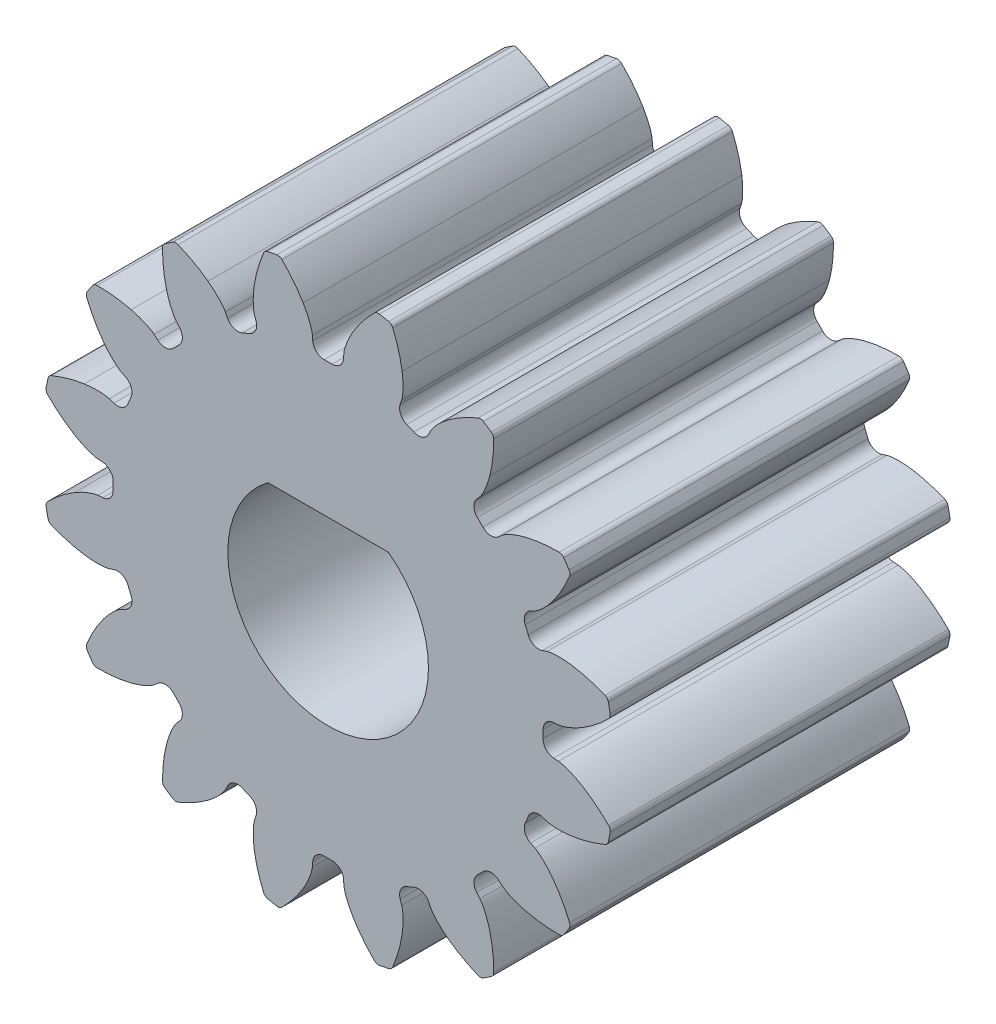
from build123d import *

# Parameters (mm, degrees)
SKETCH1_R           = 7.62
BOSS_EXTRUDE1_DEPTH = 10.16
CUT_EXTRUDE1_DEPTH  = 10.16
BOSS_EXTRUDE2_DEPTH = 10.16


with BuildPart() as part:
    # Sketch1 → Boss-Extrude1 (new body)
    with BuildSketch(Plane.XY):
        Circle(SKETCH1_R)
        with BuildLine():
            Line((-1.8, 2.4), (1.8, 2.4))
            ThreePointArc((1.8, 2.4), (0, -3), (-1.8, 2.4))
        make_face(mode=Mode.SUBTRACT)
    extrude(amount=-BOSS_EXTRUDE1_DEPTH)

    # Sketch2 → Cut-Extrude1 (cut)
    with BuildSketch(Plane.XY):
        with BuildLine():
            Line((3.071493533, 6.185439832), (3.006376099, 6.054304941))
            ThreePointArc((3.006376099, 6.054304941), (2.81897655, 5.886693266), (2.567674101, 5.894396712))
            ThreePointArc((2.567674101, 5.894396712), (2.460415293, 5.939967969), (2.352348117, 5.983587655))
            ThreePointArc((2.352348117, 5.983587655), (2.169203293, 6.155838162), (2.155211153, 6.406869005))
            Line((2.155211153, 6.406869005), (2.201892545, 6.545640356))
            add(Edge.make_bspline(
                [(2.201892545, 6.545640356), (2.202732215, 6.548271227), (2.204960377, 6.555690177), (2.20867061, 6.569870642), (2.214005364, 6.593208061), (2.222369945, 6.63697148), (2.229834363, 6.690088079), (2.235709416, 6.750578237), (2.23945835, 6.816019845), (2.24106743, 6.872208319), (2.2411847, 6.928449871), (2.239957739, 6.984628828), (2.236882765, 7.052829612), (2.230847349, 7.136715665), (2.223418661, 7.206619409), (2.216212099, 7.262171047), (2.2119757, 7.291883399)],
                knots=[0, 0, 0, 0, 0, 0.005376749, 0.015083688, 0.02853182, 0.046610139, 0.092110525, 0.119476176, 0.146842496, 0.174208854, 0.201574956, 0.228941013, 0.256307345, 0.307035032, 0.365515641, 0.365515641, 0.365515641, 0.365515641, 0.365515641], degree=4))
            ThreePointArc((2.2119757, 7.291883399), (2.916047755, 7.039962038), (3.592037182, 6.720243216))
            add(Edge.make_bspline(
                [(3.592037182, 6.720243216), (3.568031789, 6.702228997), (3.523655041, 6.668043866), (3.468972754, 6.62386733), (3.405388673, 6.568818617), (3.354989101, 6.522767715), (3.314396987, 6.483910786), (3.274711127, 6.444059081), (3.236117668, 6.403190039), (3.192494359, 6.354264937), (3.153875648, 6.307337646), (3.121594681, 6.264500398), (3.096563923, 6.227640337), (3.083834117, 6.207366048), (3.076430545, 6.194715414), (3.072760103, 6.187893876), (3.071493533, 6.185439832)],
                knots=[0.498721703, 0.498721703, 0.498721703, 0.498721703, 0.498721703, 0.557202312, 0.607929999, 0.635296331, 0.662662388, 0.69002849, 0.717394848, 0.744761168, 0.772126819, 0.817627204, 0.835705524, 0.849153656, 0.858860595, 0.864237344, 0.864237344, 0.864237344, 0.864237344, 0.864237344], degree=4))
        make_face()
        with BuildLine():
            Line((0.470624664, 6.890010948), (0.460647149, 6.743938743))
            ThreePointArc((0.460647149, 6.743938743), (0.351654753, 6.517371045), (0.116533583, 6.428318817))
            ThreePointArc((0.116533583, 6.428318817), (0, 6.429375), (-0.116533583, 6.428318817))
            ThreePointArc((-0.116533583, 6.428318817), (-0.351654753, 6.517371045), (-0.460647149, 6.743938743))
            Line((-0.460647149, 6.743938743), (-0.470624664, 6.890010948))
            add(Edge.make_bspline(
                [(-0.470624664, 6.890010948), (-0.4708557, 6.892762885), (-0.471636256, 6.900469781), (-0.473635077, 6.914990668), (-0.47763725, 6.938593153), (-0.486656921, 6.982226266), (-0.50008754, 7.034156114), (-0.51780828, 7.092290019), (-0.539388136, 7.154184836), (-0.559403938, 7.206711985), (-0.580818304, 7.258717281), (-0.603450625, 7.310150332), (-0.632390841, 7.371982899), (-0.67006864, 7.447173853), (-0.703682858, 7.508913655), (-0.731599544, 7.557478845), (-0.746883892, 7.583308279)],
                knots=[0, 0, 0, 0, 0, 0.005376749, 0.015083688, 0.02853182, 0.046610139, 0.092110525, 0.119476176, 0.146842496, 0.174208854, 0.201574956, 0.228941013, 0.256307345, 0.307035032, 0.365515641, 0.365515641, 0.365515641, 0.365515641, 0.365515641], degree=4))
            ThreePointArc((-0.746883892, 7.583308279), (0, 7.62), (0.746883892, 7.583308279))
            add(Edge.make_bspline(
                [(0.746883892, 7.583308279), (0.731599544, 7.557478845), (0.703682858, 7.508913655), (0.67006864, 7.447173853), (0.632390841, 7.371982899), (0.603450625, 7.310150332), (0.580818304, 7.258717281), (0.559403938, 7.206711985), (0.539388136, 7.154184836), (0.51780828, 7.092290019), (0.50008754, 7.034156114), (0.486656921, 6.982226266), (0.47763725, 6.938593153), (0.473635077, 6.914990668), (0.471636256, 6.900469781), (0.4708557, 6.892762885), (0.470624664, 6.890010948)],
                knots=[0.498721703, 0.498721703, 0.498721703, 0.498721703, 0.498721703, 0.557202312, 0.607929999, 0.635296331, 0.662662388, 0.69002849, 0.717394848, 0.744761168, 0.772126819, 0.817627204, 0.835705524, 0.849153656, 0.858860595, 0.864237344, 0.864237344, 0.864237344, 0.864237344, 0.864237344], degree=4))
        make_face()
        with BuildLine():
            Line((-2.201892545, 6.545640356), (-2.155211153, 6.406869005))
            ThreePointArc((-2.155211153, 6.406869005), (-2.169203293, 6.155838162), (-2.352348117, 5.983587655))
            ThreePointArc((-2.352348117, 5.983587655), (-2.460415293, 5.939967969), (-2.567674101, 5.894396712))
            ThreePointArc((-2.567674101, 5.894396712), (-2.81897655, 5.886693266), (-3.006376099, 6.054304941))
            Line((-3.006376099, 6.054304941), (-3.071493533, 6.185439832))
            add(Edge.make_bspline(
                [(-3.071493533, 6.185439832), (-3.072760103, 6.187893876), (-3.076430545, 6.194715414), (-3.083834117, 6.207366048), (-3.096563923, 6.227640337), (-3.121594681, 6.264500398), (-3.153875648, 6.307337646), (-3.192494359, 6.354264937), (-3.236117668, 6.403190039), (-3.274711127, 6.444059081), (-3.314396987, 6.483910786), (-3.354989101, 6.522767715), (-3.405388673, 6.568818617), (-3.468972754, 6.62386733), (-3.523655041, 6.668043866), (-3.568031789, 6.702228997), (-3.592037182, 6.720243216)],
                knots=[0, 0, 0, 0, 0, 0.005376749, 0.015083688, 0.02853182, 0.046610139, 0.092110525, 0.119476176, 0.146842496, 0.174208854, 0.201574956, 0.228941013, 0.256307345, 0.307035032, 0.365515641, 0.365515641, 0.365515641, 0.365515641, 0.365515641], degree=4))
            ThreePointArc((-3.592037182, 6.720243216), (-2.916047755, 7.039962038), (-2.2119757, 7.291883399))
            add(Edge.make_bspline(
                [(-2.2119757, 7.291883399), (-2.216212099, 7.262171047), (-2.223418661, 7.206619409), (-2.230847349, 7.136715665), (-2.236882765, 7.052829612), (-2.239957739, 6.984628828), (-2.2411847, 6.928449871), (-2.24106743, 6.872208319), (-2.23945835, 6.816019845), (-2.235709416, 6.750578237), (-2.229834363, 6.690088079), (-2.222369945, 6.63697148), (-2.214005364, 6.593208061), (-2.20867061, 6.569870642), (-2.204960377, 6.555690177), (-2.202732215, 6.548271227), (-2.201892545, 6.545640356)],
                knots=[0.498721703, 0.498721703, 0.498721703, 0.498721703, 0.498721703, 0.557202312, 0.607929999, 0.635296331, 0.662662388, 0.69002849, 0.717394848, 0.744761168, 0.772126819, 0.817627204, 0.835705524, 0.849153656, 0.858860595, 0.864237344, 0.864237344, 0.864237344, 0.864237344, 0.864237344], degree=4))
        make_face()
        with BuildLine():
            Line((-4.539191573, 5.204755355), (-4.442958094, 5.09441154))
            ThreePointArc((-4.442958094, 5.09441154), (-4.359819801, 4.857134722), (-4.463106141, 4.627909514))
            ThreePointArc((-4.463106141, 4.627909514), (-4.546254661, 4.546254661), (-4.627909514, 4.463106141))
            ThreePointArc((-4.627909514, 4.463106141), (-4.857134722, 4.359819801), (-5.09441154, 4.442958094))
            Line((-5.09441154, 4.442958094), (-5.204755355, 4.539191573))
            add(Edge.make_bspline(
                [(-5.204755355, 4.539191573), (-5.206864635, 4.540974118), (-5.212866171, 4.545871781), (-5.224547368, 4.554726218), (-5.244066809, 4.568585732), (-5.281297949, 4.593061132), (-5.327514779, 4.620284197), (-5.381152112, 4.64886062), (-5.44017762, 4.677367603), (-5.491473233, 4.700356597), (-5.543388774, 4.721987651), (-5.5957609, 4.742352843), (-5.65994695, 4.765611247), (-5.739757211, 4.792137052), (-5.807182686, 4.812024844), (-5.861263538, 4.826625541), (-5.890335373, 4.834082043)],
                knots=[0, 0, 0, 0, 0, 0.005376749, 0.015083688, 0.02853182, 0.046610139, 0.092110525, 0.119476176, 0.146842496, 0.174208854, 0.201574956, 0.228941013, 0.256307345, 0.307035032, 0.365515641, 0.365515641, 0.365515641, 0.365515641, 0.365515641], degree=4))
            ThreePointArc((-5.890335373, 4.834082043), (-5.388153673, 5.388153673), (-4.834082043, 5.890335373))
            add(Edge.make_bspline(
                [(-4.834082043, 5.890335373), (-4.826625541, 5.861263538), (-4.812024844, 5.807182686), (-4.792137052, 5.739757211), (-4.765611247, 5.65994695), (-4.742352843, 5.5957609), (-4.721987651, 5.543388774), (-4.700356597, 5.491473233), (-4.677367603, 5.44017762), (-4.64886062, 5.381152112), (-4.620284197, 5.327514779), (-4.593061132, 5.281297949), (-4.568585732, 5.244066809), (-4.554726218, 5.224547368), (-4.545871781, 5.212866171), (-4.540974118, 5.206864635), (-4.539191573, 5.204755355)],
                knots=[0.498721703, 0.498721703, 0.498721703, 0.498721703, 0.498721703, 0.557202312, 0.607929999, 0.635296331, 0.662662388, 0.69002849, 0.717394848, 0.744761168, 0.772126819, 0.817627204, 0.835705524, 0.849153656, 0.858860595, 0.864237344, 0.864237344, 0.864237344, 0.864237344, 0.864237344], degree=4))
        make_face()
        with BuildLine():
            Line((-6.185439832, 3.071493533), (-6.054304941, 3.006376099))
            ThreePointArc((-6.054304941, 3.006376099), (-5.886693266, 2.81897655), (-5.894396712, 2.567674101))
            ThreePointArc((-5.894396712, 2.567674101), (-5.939967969, 2.460415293), (-5.983587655, 2.352348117))
            ThreePointArc((-5.983587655, 2.352348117), (-6.155838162, 2.169203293), (-6.406869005, 2.155211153))
            Line((-6.406869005, 2.155211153), (-6.545640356, 2.201892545))
            add(Edge.make_bspline(
                [(-6.545640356, 2.201892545), (-6.548271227, 2.202732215), (-6.555690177, 2.204960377), (-6.569870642, 2.20867061), (-6.593208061, 2.214005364), (-6.63697148, 2.222369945), (-6.690088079, 2.229834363), (-6.750578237, 2.235709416), (-6.816019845, 2.23945835), (-6.872208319, 2.24106743), (-6.928449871, 2.2411847), (-6.984628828, 2.239957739), (-7.052829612, 2.236882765), (-7.136715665, 2.230847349), (-7.206619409, 2.223418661), (-7.262171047, 2.216212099), (-7.291883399, 2.2119757)],
                knots=[0, 0, 0, 0, 0, 0.005376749, 0.015083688, 0.02853182, 0.046610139, 0.092110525, 0.119476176, 0.146842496, 0.174208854, 0.201574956, 0.228941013, 0.256307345, 0.307035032, 0.365515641, 0.365515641, 0.365515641, 0.365515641, 0.365515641], degree=4))
            ThreePointArc((-7.291883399, 2.2119757), (-7.039962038, 2.916047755), (-6.720243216, 3.592037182))
            add(Edge.make_bspline(
                [(-6.720243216, 3.592037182), (-6.702228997, 3.568031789), (-6.668043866, 3.523655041), (-6.62386733, 3.468972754), (-6.568818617, 3.405388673), (-6.522767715, 3.354989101), (-6.483910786, 3.314396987), (-6.444059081, 3.274711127), (-6.403190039, 3.236117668), (-6.354264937, 3.192494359), (-6.307337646, 3.153875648), (-6.264500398, 3.121594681), (-6.227640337, 3.096563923), (-6.207366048, 3.083834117), (-6.194715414, 3.076430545), (-6.187893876, 3.072760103), (-6.185439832, 3.071493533)],
                knots=[0.498721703, 0.498721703, 0.498721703, 0.498721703, 0.498721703, 0.557202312, 0.607929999, 0.635296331, 0.662662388, 0.69002849, 0.717394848, 0.744761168, 0.772126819, 0.817627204, 0.835705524, 0.849153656, 0.858860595, 0.864237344, 0.864237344, 0.864237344, 0.864237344, 0.864237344], degree=4))
        make_face()
        with BuildLine():
            Line((-6.890010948, 0.470624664), (-6.743938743, 0.460647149))
            ThreePointArc((-6.743938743, 0.460647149), (-6.517371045, 0.351654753), (-6.428318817, 0.116533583))
            ThreePointArc((-6.428318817, 0.116533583), (-6.429375, 0), (-6.428318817, -0.116533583))
            ThreePointArc((-6.428318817, -0.116533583), (-6.517371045, -0.351654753), (-6.743938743, -0.460647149))
            Line((-6.743938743, -0.460647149), (-6.890010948, -0.470624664))
            add(Edge.make_bspline(
                [(-6.890010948, -0.470624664), (-6.892762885, -0.4708557), (-6.900469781, -0.471636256), (-6.914990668, -0.473635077), (-6.938593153, -0.47763725), (-6.982226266, -0.486656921), (-7.034156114, -0.50008754), (-7.092290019, -0.51780828), (-7.154184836, -0.539388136), (-7.206711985, -0.559403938), (-7.258717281, -0.580818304), (-7.310150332, -0.603450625), (-7.371982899, -0.632390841), (-7.447173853, -0.67006864), (-7.508913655, -0.703682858), (-7.557478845, -0.731599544), (-7.583308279, -0.746883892)],
                knots=[0, 0, 0, 0, 0, 0.005376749, 0.015083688, 0.02853182, 0.046610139, 0.092110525, 0.119476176, 0.146842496, 0.174208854, 0.201574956, 0.228941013, 0.256307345, 0.307035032, 0.365515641, 0.365515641, 0.365515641, 0.365515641, 0.365515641], degree=4))
            ThreePointArc((-7.583308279, -0.746883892), (-7.62, 0), (-7.583308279, 0.746883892))
            add(Edge.make_bspline(
                [(-7.583308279, 0.746883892), (-7.557478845, 0.731599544), (-7.508913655, 0.703682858), (-7.447173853, 0.67006864), (-7.371982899, 0.632390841), (-7.310150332, 0.603450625), (-7.258717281, 0.580818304), (-7.206711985, 0.559403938), (-7.154184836, 0.539388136), (-7.092290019, 0.51780828), (-7.034156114, 0.50008754), (-6.982226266, 0.486656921), (-6.938593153, 0.47763725), (-6.914990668, 0.473635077), (-6.900469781, 0.471636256), (-6.892762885, 0.4708557), (-6.890010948, 0.470624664)],
                knots=[0.498721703, 0.498721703, 0.498721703, 0.498721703, 0.498721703, 0.557202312, 0.607929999, 0.635296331, 0.662662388, 0.69002849, 0.717394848, 0.744761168, 0.772126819, 0.817627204, 0.835705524, 0.849153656, 0.858860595, 0.864237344, 0.864237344, 0.864237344, 0.864237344, 0.864237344], degree=4))
        make_face()
        with BuildLine():
            Line((-6.545640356, -2.201892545), (-6.406869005, -2.155211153))
            ThreePointArc((-6.406869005, -2.155211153), (-6.155838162, -2.169203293), (-5.983587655, -2.352348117))
            ThreePointArc((-5.983587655, -2.352348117), (-5.939967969, -2.460415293), (-5.894396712, -2.567674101))
            ThreePointArc((-5.894396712, -2.567674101), (-5.886693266, -2.81897655), (-6.054304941, -3.006376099))
            Line((-6.054304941, -3.006376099), (-6.185439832, -3.071493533))
            add(Edge.make_bspline(
                [(-6.185439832, -3.071493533), (-6.187893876, -3.072760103), (-6.194715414, -3.076430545), (-6.207366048, -3.083834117), (-6.227640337, -3.096563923), (-6.264500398, -3.121594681), (-6.307337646, -3.153875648), (-6.354264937, -3.192494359), (-6.403190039, -3.236117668), (-6.444059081, -3.274711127), (-6.483910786, -3.314396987), (-6.522767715, -3.354989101), (-6.568818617, -3.405388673), (-6.62386733, -3.468972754), (-6.668043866, -3.523655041), (-6.702228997, -3.568031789), (-6.720243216, -3.592037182)],
                knots=[0, 0, 0, 0, 0, 0.005376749, 0.015083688, 0.02853182, 0.046610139, 0.092110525, 0.119476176, 0.146842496, 0.174208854, 0.201574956, 0.228941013, 0.256307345, 0.307035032, 0.365515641, 0.365515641, 0.365515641, 0.365515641, 0.365515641], degree=4))
            ThreePointArc((-6.720243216, -3.592037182), (-7.039962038, -2.916047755), (-7.291883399, -2.2119757))
            add(Edge.make_bspline(
                [(-7.291883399, -2.2119757), (-7.262171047, -2.216212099), (-7.206619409, -2.223418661), (-7.136715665, -2.230847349), (-7.052829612, -2.236882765), (-6.984628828, -2.239957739), (-6.928449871, -2.2411847), (-6.872208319, -2.24106743), (-6.816019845, -2.23945835), (-6.750578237, -2.235709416), (-6.690088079, -2.229834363), (-6.63697148, -2.222369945), (-6.593208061, -2.214005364), (-6.569870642, -2.20867061), (-6.555690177, -2.204960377), (-6.548271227, -2.202732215), (-6.545640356, -2.201892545)],
                knots=[0.498721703, 0.498721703, 0.498721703, 0.498721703, 0.498721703, 0.557202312, 0.607929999, 0.635296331, 0.662662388, 0.69002849, 0.717394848, 0.744761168, 0.772126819, 0.817627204, 0.835705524, 0.849153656, 0.858860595, 0.864237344, 0.864237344, 0.864237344, 0.864237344, 0.864237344], degree=4))
        make_face()
        with BuildLine():
            Line((-5.204755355, -4.539191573), (-5.09441154, -4.442958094))
            ThreePointArc((-5.09441154, -4.442958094), (-4.857134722, -4.359819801), (-4.627909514, -4.463106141))
            ThreePointArc((-4.627909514, -4.463106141), (-4.546254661, -4.546254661), (-4.463106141, -4.627909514))
            ThreePointArc((-4.463106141, -4.627909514), (-4.359819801, -4.857134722), (-4.442958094, -5.09441154))
            Line((-4.442958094, -5.09441154), (-4.539191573, -5.204755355))
            add(Edge.make_bspline(
                [(-4.539191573, -5.204755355), (-4.540974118, -5.206864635), (-4.545871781, -5.212866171), (-4.554726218, -5.224547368), (-4.568585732, -5.244066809), (-4.593061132, -5.281297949), (-4.620284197, -5.327514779), (-4.64886062, -5.381152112), (-4.677367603, -5.44017762), (-4.700356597, -5.491473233), (-4.721987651, -5.543388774), (-4.742352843, -5.5957609), (-4.765611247, -5.65994695), (-4.792137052, -5.739757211), (-4.812024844, -5.807182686), (-4.826625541, -5.861263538), (-4.834082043, -5.890335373)],
                knots=[0, 0, 0, 0, 0, 0.005376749, 0.015083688, 0.02853182, 0.046610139, 0.092110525, 0.119476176, 0.146842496, 0.174208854, 0.201574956, 0.228941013, 0.256307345, 0.307035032, 0.365515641, 0.365515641, 0.365515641, 0.365515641, 0.365515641], degree=4))
            ThreePointArc((-4.834082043, -5.890335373), (-5.388153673, -5.388153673), (-5.890335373, -4.834082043))
            add(Edge.make_bspline(
                [(-5.890335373, -4.834082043), (-5.861263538, -4.826625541), (-5.807182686, -4.812024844), (-5.739757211, -4.792137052), (-5.65994695, -4.765611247), (-5.5957609, -4.742352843), (-5.543388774, -4.721987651), (-5.491473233, -4.700356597), (-5.44017762, -4.677367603), (-5.381152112, -4.64886062), (-5.327514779, -4.620284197), (-5.281297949, -4.593061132), (-5.244066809, -4.568585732), (-5.224547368, -4.554726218), (-5.212866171, -4.545871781), (-5.206864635, -4.540974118), (-5.204755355, -4.539191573)],
                knots=[0.498721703, 0.498721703, 0.498721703, 0.498721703, 0.498721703, 0.557202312, 0.607929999, 0.635296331, 0.662662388, 0.69002849, 0.717394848, 0.744761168, 0.772126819, 0.817627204, 0.835705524, 0.849153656, 0.858860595, 0.864237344, 0.864237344, 0.864237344, 0.864237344, 0.864237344], degree=4))
        make_face()
        with BuildLine():
            Line((-3.071493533, -6.185439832), (-3.006376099, -6.054304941))
            ThreePointArc((-3.006376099, -6.054304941), (-2.81897655, -5.886693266), (-2.567674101, -5.894396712))
            ThreePointArc((-2.567674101, -5.894396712), (-2.460415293, -5.939967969), (-2.352348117, -5.983587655))
            ThreePointArc((-2.352348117, -5.983587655), (-2.169203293, -6.155838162), (-2.155211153, -6.406869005))
            Line((-2.155211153, -6.406869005), (-2.201892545, -6.545640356))
            add(Edge.make_bspline(
                [(-2.201892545, -6.545640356), (-2.202732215, -6.548271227), (-2.204960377, -6.555690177), (-2.20867061, -6.569870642), (-2.214005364, -6.593208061), (-2.222369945, -6.63697148), (-2.229834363, -6.690088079), (-2.235709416, -6.750578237), (-2.23945835, -6.816019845), (-2.24106743, -6.872208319), (-2.2411847, -6.928449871), (-2.239957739, -6.984628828), (-2.236882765, -7.052829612), (-2.230847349, -7.136715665), (-2.223418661, -7.206619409), (-2.216212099, -7.262171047), (-2.2119757, -7.291883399)],
                knots=[0, 0, 0, 0, 0, 0.005376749, 0.015083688, 0.02853182, 0.046610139, 0.092110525, 0.119476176, 0.146842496, 0.174208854, 0.201574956, 0.228941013, 0.256307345, 0.307035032, 0.365515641, 0.365515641, 0.365515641, 0.365515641, 0.365515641], degree=4))
            ThreePointArc((-2.2119757, -7.291883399), (-2.916047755, -7.039962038), (-3.592037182, -6.720243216))
            add(Edge.make_bspline(
                [(-3.592037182, -6.720243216), (-3.568031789, -6.702228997), (-3.523655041, -6.668043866), (-3.468972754, -6.62386733), (-3.405388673, -6.568818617), (-3.354989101, -6.522767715), (-3.314396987, -6.483910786), (-3.274711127, -6.444059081), (-3.236117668, -6.403190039), (-3.192494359, -6.354264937), (-3.153875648, -6.307337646), (-3.121594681, -6.264500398), (-3.096563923, -6.227640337), (-3.083834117, -6.207366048), (-3.076430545, -6.194715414), (-3.072760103, -6.187893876), (-3.071493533, -6.185439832)],
                knots=[0.498721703, 0.498721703, 0.498721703, 0.498721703, 0.498721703, 0.557202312, 0.607929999, 0.635296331, 0.662662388, 0.69002849, 0.717394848, 0.744761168, 0.772126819, 0.817627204, 0.835705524, 0.849153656, 0.858860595, 0.864237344, 0.864237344, 0.864237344, 0.864237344, 0.864237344], degree=4))
        make_face()
        with BuildLine():
            Line((-0.470624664, -6.890010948), (-0.460647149, -6.743938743))
            ThreePointArc((-0.460647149, -6.743938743), (-0.351654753, -6.517371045), (-0.116533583, -6.428318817))
            ThreePointArc((-0.116533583, -6.428318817), (0, -6.429375), (0.116533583, -6.428318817))
            ThreePointArc((0.116533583, -6.428318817), (0.351654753, -6.517371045), (0.460647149, -6.743938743))
            Line((0.460647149, -6.743938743), (0.470624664, -6.890010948))
            add(Edge.make_bspline(
                [(0.470624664, -6.890010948), (0.4708557, -6.892762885), (0.471636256, -6.900469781), (0.473635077, -6.914990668), (0.47763725, -6.938593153), (0.486656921, -6.982226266), (0.50008754, -7.034156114), (0.51780828, -7.092290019), (0.539388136, -7.154184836), (0.559403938, -7.206711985), (0.580818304, -7.258717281), (0.603450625, -7.310150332), (0.632390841, -7.371982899), (0.67006864, -7.447173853), (0.703682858, -7.508913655), (0.731599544, -7.557478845), (0.746883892, -7.583308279)],
                knots=[0, 0, 0, 0, 0, 0.005376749, 0.015083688, 0.02853182, 0.046610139, 0.092110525, 0.119476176, 0.146842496, 0.174208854, 0.201574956, 0.228941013, 0.256307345, 0.307035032, 0.365515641, 0.365515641, 0.365515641, 0.365515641, 0.365515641], degree=4))
            ThreePointArc((0.746883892, -7.583308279), (0, -7.62), (-0.746883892, -7.583308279))
            add(Edge.make_bspline(
                [(-0.746883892, -7.583308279), (-0.731599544, -7.557478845), (-0.703682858, -7.508913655), (-0.67006864, -7.447173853), (-0.632390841, -7.371982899), (-0.603450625, -7.310150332), (-0.580818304, -7.258717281), (-0.559403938, -7.206711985), (-0.539388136, -7.154184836), (-0.51780828, -7.092290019), (-0.50008754, -7.034156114), (-0.486656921, -6.982226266), (-0.47763725, -6.938593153), (-0.473635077, -6.914990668), (-0.471636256, -6.900469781), (-0.4708557, -6.892762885), (-0.470624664, -6.890010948)],
                knots=[0.498721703, 0.498721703, 0.498721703, 0.498721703, 0.498721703, 0.557202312, 0.607929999, 0.635296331, 0.662662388, 0.69002849, 0.717394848, 0.744761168, 0.772126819, 0.817627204, 0.835705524, 0.849153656, 0.858860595, 0.864237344, 0.864237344, 0.864237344, 0.864237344, 0.864237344], degree=4))
        make_face()
        with BuildLine():
            Line((2.201892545, -6.545640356), (2.155211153, -6.406869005))
            ThreePointArc((2.155211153, -6.406869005), (2.169203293, -6.155838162), (2.352348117, -5.983587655))
            ThreePointArc((2.352348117, -5.983587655), (2.460415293, -5.939967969), (2.567674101, -5.894396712))
            ThreePointArc((2.567674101, -5.894396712), (2.81897655, -5.886693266), (3.006376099, -6.054304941))
            Line((3.006376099, -6.054304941), (3.071493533, -6.185439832))
            add(Edge.make_bspline(
                [(3.071493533, -6.185439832), (3.072760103, -6.187893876), (3.076430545, -6.194715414), (3.083834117, -6.207366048), (3.096563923, -6.227640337), (3.121594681, -6.264500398), (3.153875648, -6.307337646), (3.192494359, -6.354264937), (3.236117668, -6.403190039), (3.274711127, -6.444059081), (3.314396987, -6.483910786), (3.354989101, -6.522767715), (3.405388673, -6.568818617), (3.468972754, -6.62386733), (3.523655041, -6.668043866), (3.568031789, -6.702228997), (3.592037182, -6.720243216)],
                knots=[0, 0, 0, 0, 0, 0.005376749, 0.015083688, 0.02853182, 0.046610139, 0.092110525, 0.119476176, 0.146842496, 0.174208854, 0.201574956, 0.228941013, 0.256307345, 0.307035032, 0.365515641, 0.365515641, 0.365515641, 0.365515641, 0.365515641], degree=4))
            ThreePointArc((3.592037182, -6.720243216), (2.916047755, -7.039962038), (2.2119757, -7.291883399))
            add(Edge.make_bspline(
                [(2.2119757, -7.291883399), (2.216212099, -7.262171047), (2.223418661, -7.206619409), (2.230847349, -7.136715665), (2.236882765, -7.052829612), (2.239957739, -6.984628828), (2.2411847, -6.928449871), (2.24106743, -6.872208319), (2.23945835, -6.816019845), (2.235709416, -6.750578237), (2.229834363, -6.690088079), (2.222369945, -6.63697148), (2.214005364, -6.593208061), (2.20867061, -6.569870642), (2.204960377, -6.555690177), (2.202732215, -6.548271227), (2.201892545, -6.545640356)],
                knots=[0.498721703, 0.498721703, 0.498721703, 0.498721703, 0.498721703, 0.557202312, 0.607929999, 0.635296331, 0.662662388, 0.69002849, 0.717394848, 0.744761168, 0.772126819, 0.817627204, 0.835705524, 0.849153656, 0.858860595, 0.864237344, 0.864237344, 0.864237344, 0.864237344, 0.864237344], degree=4))
        make_face()
        with BuildLine():
            Line((4.539191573, -5.204755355), (4.442958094, -5.09441154))
            ThreePointArc((4.442958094, -5.09441154), (4.359819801, -4.857134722), (4.463106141, -4.627909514))
            ThreePointArc((4.463106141, -4.627909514), (4.546254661, -4.546254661), (4.627909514, -4.463106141))
            ThreePointArc((4.627909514, -4.463106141), (4.857134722, -4.359819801), (5.09441154, -4.442958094))
            Line((5.09441154, -4.442958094), (5.204755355, -4.539191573))
            add(Edge.make_bspline(
                [(5.204755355, -4.539191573), (5.206864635, -4.540974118), (5.212866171, -4.545871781), (5.224547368, -4.554726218), (5.244066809, -4.568585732), (5.281297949, -4.593061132), (5.327514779, -4.620284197), (5.381152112, -4.64886062), (5.44017762, -4.677367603), (5.491473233, -4.700356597), (5.543388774, -4.721987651), (5.5957609, -4.742352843), (5.65994695, -4.765611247), (5.739757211, -4.792137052), (5.807182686, -4.812024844), (5.861263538, -4.826625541), (5.890335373, -4.834082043)],
                knots=[0, 0, 0, 0, 0, 0.005376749, 0.015083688, 0.02853182, 0.046610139, 0.092110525, 0.119476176, 0.146842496, 0.174208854, 0.201574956, 0.228941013, 0.256307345, 0.307035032, 0.365515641, 0.365515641, 0.365515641, 0.365515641, 0.365515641], degree=4))
            ThreePointArc((5.890335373, -4.834082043), (5.388153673, -5.388153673), (4.834082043, -5.890335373))
            add(Edge.make_bspline(
                [(4.834082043, -5.890335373), (4.826625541, -5.861263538), (4.812024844, -5.807182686), (4.792137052, -5.739757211), (4.765611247, -5.65994695), (4.742352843, -5.5957609), (4.721987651, -5.543388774), (4.700356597, -5.491473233), (4.677367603, -5.44017762), (4.64886062, -5.381152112), (4.620284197, -5.327514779), (4.593061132, -5.281297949), (4.568585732, -5.244066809), (4.554726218, -5.224547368), (4.545871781, -5.212866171), (4.540974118, -5.206864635), (4.539191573, -5.204755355)],
                knots=[0.498721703, 0.498721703, 0.498721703, 0.498721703, 0.498721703, 0.557202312, 0.607929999, 0.635296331, 0.662662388, 0.69002849, 0.717394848, 0.744761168, 0.772126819, 0.817627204, 0.835705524, 0.849153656, 0.858860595, 0.864237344, 0.864237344, 0.864237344, 0.864237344, 0.864237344], degree=4))
        make_face()
        with BuildLine():
            Line((6.185439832, -3.071493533), (6.054304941, -3.006376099))
            ThreePointArc((6.054304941, -3.006376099), (5.886693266, -2.81897655), (5.894396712, -2.567674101))
            ThreePointArc((5.894396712, -2.567674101), (5.939967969, -2.460415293), (5.983587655, -2.352348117))
            ThreePointArc((5.983587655, -2.352348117), (6.155838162, -2.169203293), (6.406869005, -2.155211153))
            Line((6.406869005, -2.155211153), (6.545640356, -2.201892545))
            add(Edge.make_bspline(
                [(6.545640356, -2.201892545), (6.548271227, -2.202732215), (6.555690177, -2.204960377), (6.569870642, -2.20867061), (6.593208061, -2.214005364), (6.63697148, -2.222369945), (6.690088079, -2.229834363), (6.750578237, -2.235709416), (6.816019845, -2.23945835), (6.872208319, -2.24106743), (6.928449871, -2.2411847), (6.984628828, -2.239957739), (7.052829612, -2.236882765), (7.136715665, -2.230847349), (7.206619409, -2.223418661), (7.262171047, -2.216212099), (7.291883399, -2.2119757)],
                knots=[0, 0, 0, 0, 0, 0.005376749, 0.015083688, 0.02853182, 0.046610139, 0.092110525, 0.119476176, 0.146842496, 0.174208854, 0.201574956, 0.228941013, 0.256307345, 0.307035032, 0.365515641, 0.365515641, 0.365515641, 0.365515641, 0.365515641], degree=4))
            ThreePointArc((7.291883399, -2.2119757), (7.039962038, -2.916047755), (6.720243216, -3.592037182))
            add(Edge.make_bspline(
                [(6.720243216, -3.592037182), (6.702228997, -3.568031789), (6.668043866, -3.523655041), (6.62386733, -3.468972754), (6.568818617, -3.405388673), (6.522767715, -3.354989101), (6.483910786, -3.314396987), (6.444059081, -3.274711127), (6.403190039, -3.236117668), (6.354264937, -3.192494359), (6.307337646, -3.153875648), (6.264500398, -3.121594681), (6.227640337, -3.096563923), (6.207366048, -3.083834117), (6.194715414, -3.076430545), (6.187893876, -3.072760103), (6.185439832, -3.071493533)],
                knots=[0.498721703, 0.498721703, 0.498721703, 0.498721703, 0.498721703, 0.557202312, 0.607929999, 0.635296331, 0.662662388, 0.69002849, 0.717394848, 0.744761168, 0.772126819, 0.817627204, 0.835705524, 0.849153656, 0.858860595, 0.864237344, 0.864237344, 0.864237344, 0.864237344, 0.864237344], degree=4))
        make_face()
        with BuildLine():
            Line((6.890010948, -0.470624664), (6.743938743, -0.460647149))
            ThreePointArc((6.743938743, -0.460647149), (6.517371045, -0.351654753), (6.428318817, -0.116533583))
            ThreePointArc((6.428318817, -0.116533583), (6.429375, 0), (6.428318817, 0.116533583))
            ThreePointArc((6.428318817, 0.116533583), (6.517371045, 0.351654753), (6.743938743, 0.460647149))
            Line((6.743938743, 0.460647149), (6.890010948, 0.470624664))
            add(Edge.make_bspline(
                [(6.890010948, 0.470624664), (6.892762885, 0.4708557), (6.900469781, 0.471636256), (6.914990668, 0.473635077), (6.938593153, 0.47763725), (6.982226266, 0.486656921), (7.034156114, 0.50008754), (7.092290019, 0.51780828), (7.154184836, 0.539388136), (7.206711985, 0.559403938), (7.258717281, 0.580818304), (7.310150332, 0.603450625), (7.371982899, 0.632390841), (7.447173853, 0.67006864), (7.508913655, 0.703682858), (7.557478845, 0.731599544), (7.583308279, 0.746883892)],
                knots=[0, 0, 0, 0, 0, 0.005376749, 0.015083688, 0.02853182, 0.046610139, 0.092110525, 0.119476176, 0.146842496, 0.174208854, 0.201574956, 0.228941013, 0.256307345, 0.307035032, 0.365515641, 0.365515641, 0.365515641, 0.365515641, 0.365515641], degree=4))
            ThreePointArc((7.583308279, 0.746883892), (7.62, 0), (7.583308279, -0.746883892))
            add(Edge.make_bspline(
                [(7.583308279, -0.746883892), (7.557478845, -0.731599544), (7.508913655, -0.703682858), (7.447173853, -0.67006864), (7.371982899, -0.632390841), (7.310150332, -0.603450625), (7.258717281, -0.580818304), (7.206711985, -0.559403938), (7.154184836, -0.539388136), (7.092290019, -0.51780828), (7.034156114, -0.50008754), (6.982226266, -0.486656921), (6.938593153, -0.47763725), (6.914990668, -0.473635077), (6.900469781, -0.471636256), (6.892762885, -0.4708557), (6.890010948, -0.470624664)],
                knots=[0.498721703, 0.498721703, 0.498721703, 0.498721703, 0.498721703, 0.557202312, 0.607929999, 0.635296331, 0.662662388, 0.69002849, 0.717394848, 0.744761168, 0.772126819, 0.817627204, 0.835705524, 0.849153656, 0.858860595, 0.864237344, 0.864237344, 0.864237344, 0.864237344, 0.864237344], degree=4))
        make_face()
        with BuildLine():
            Line((6.545640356, 2.201892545), (6.406869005, 2.155211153))
            ThreePointArc((6.406869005, 2.155211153), (6.155838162, 2.169203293), (5.983587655, 2.352348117))
            ThreePointArc((5.983587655, 2.352348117), (5.939967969, 2.460415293), (5.894396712, 2.567674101))
            ThreePointArc((5.894396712, 2.567674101), (5.886693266, 2.81897655), (6.054304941, 3.006376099))
            Line((6.054304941, 3.006376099), (6.185439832, 3.071493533))
            add(Edge.make_bspline(
                [(6.185439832, 3.071493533), (6.187893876, 3.072760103), (6.194715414, 3.076430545), (6.207366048, 3.083834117), (6.227640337, 3.096563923), (6.264500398, 3.121594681), (6.307337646, 3.153875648), (6.354264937, 3.192494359), (6.403190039, 3.236117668), (6.444059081, 3.274711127), (6.483910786, 3.314396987), (6.522767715, 3.354989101), (6.568818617, 3.405388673), (6.62386733, 3.468972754), (6.668043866, 3.523655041), (6.702228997, 3.568031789), (6.720243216, 3.592037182)],
                knots=[0, 0, 0, 0, 0, 0.005376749, 0.015083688, 0.02853182, 0.046610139, 0.092110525, 0.119476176, 0.146842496, 0.174208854, 0.201574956, 0.228941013, 0.256307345, 0.307035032, 0.365515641, 0.365515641, 0.365515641, 0.365515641, 0.365515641], degree=4))
            ThreePointArc((6.720243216, 3.592037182), (7.039962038, 2.916047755), (7.291883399, 2.2119757))
            add(Edge.make_bspline(
                [(7.291883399, 2.2119757), (7.262171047, 2.216212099), (7.206619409, 2.223418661), (7.136715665, 2.230847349), (7.052829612, 2.236882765), (6.984628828, 2.239957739), (6.928449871, 2.2411847), (6.872208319, 2.24106743), (6.816019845, 2.23945835), (6.750578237, 2.235709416), (6.690088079, 2.229834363), (6.63697148, 2.222369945), (6.593208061, 2.214005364), (6.569870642, 2.20867061), (6.555690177, 2.204960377), (6.548271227, 2.202732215), (6.545640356, 2.201892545)],
                knots=[0.498721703, 0.498721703, 0.498721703, 0.498721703, 0.498721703, 0.557202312, 0.607929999, 0.635296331, 0.662662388, 0.69002849, 0.717394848, 0.744761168, 0.772126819, 0.817627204, 0.835705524, 0.849153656, 0.858860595, 0.864237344, 0.864237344, 0.864237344, 0.864237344, 0.864237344], degree=4))
        make_face()
        with BuildLine():
            Line((5.204755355, 4.539191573), (5.09441154, 4.442958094))
            ThreePointArc((5.09441154, 4.442958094), (4.857134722, 4.359819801), (4.627909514, 4.463106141))
            ThreePointArc((4.627909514, 4.463106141), (4.546254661, 4.546254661), (4.463106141, 4.627909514))
            ThreePointArc((4.463106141, 4.627909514), (4.359819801, 4.857134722), (4.442958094, 5.09441154))
            Line((4.442958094, 5.09441154), (4.539191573, 5.204755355))
            add(Edge.make_bspline(
                [(4.539191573, 5.204755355), (4.540974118, 5.206864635), (4.545871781, 5.212866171), (4.554726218, 5.224547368), (4.568585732, 5.244066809), (4.593061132, 5.281297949), (4.620284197, 5.327514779), (4.64886062, 5.381152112), (4.677367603, 5.44017762), (4.700356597, 5.491473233), (4.721987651, 5.543388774), (4.742352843, 5.5957609), (4.765611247, 5.65994695), (4.792137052, 5.739757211), (4.812024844, 5.807182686), (4.826625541, 5.861263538), (4.834082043, 5.890335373)],
                knots=[0, 0, 0, 0, 0, 0.005376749, 0.015083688, 0.02853182, 0.046610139, 0.092110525, 0.119476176, 0.146842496, 0.174208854, 0.201574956, 0.228941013, 0.256307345, 0.307035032, 0.365515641, 0.365515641, 0.365515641, 0.365515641, 0.365515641], degree=4))
            ThreePointArc((4.834082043, 5.890335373), (5.388153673, 5.388153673), (5.890335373, 4.834082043))
            add(Edge.make_bspline(
                [(5.890335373, 4.834082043), (5.861263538, 4.826625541), (5.807182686, 4.812024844), (5.739757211, 4.792137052), (5.65994695, 4.765611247), (5.5957609, 4.742352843), (5.543388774, 4.721987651), (5.491473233, 4.700356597), (5.44017762, 4.677367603), (5.381152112, 4.64886062), (5.327514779, 4.620284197), (5.281297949, 4.593061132), (5.244066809, 4.568585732), (5.224547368, 4.554726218), (5.212866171, 4.545871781), (5.206864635, 4.540974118), (5.204755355, 4.539191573)],
                knots=[0.498721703, 0.498721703, 0.498721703, 0.498721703, 0.498721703, 0.557202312, 0.607929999, 0.635296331, 0.662662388, 0.69002849, 0.717394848, 0.744761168, 0.772126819, 0.817627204, 0.835705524, 0.849153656, 0.858860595, 0.864237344, 0.864237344, 0.864237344, 0.864237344, 0.864237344], degree=4))
        make_face()
    extrude(amount=-CUT_EXTRUDE1_DEPTH, mode=Mode.SUBTRACT)

    # Sketch3 → Boss-Extrude2 (add)
    with BuildSketch(Plane.XY):
        with BuildLine():
            Line((3.071493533, 6.185439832), (3.006376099, 6.054304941))
            ThreePointArc((3.006376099, 6.054304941), (2.81897655, 5.886693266), (2.567674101, 5.894396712))
            ThreePointArc((2.567674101, 5.894396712), (2.460415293, 5.939967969), (2.352348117, 5.983587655))
            ThreePointArc((2.352348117, 5.983587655), (2.169203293, 6.155838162), (2.155211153, 6.406869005))
            Line((2.155211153, 6.406869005), (2.201892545, 6.545640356))
            add(Edge.make_bspline(
                [(2.201892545, 6.545640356), (2.202732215, 6.548271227), (2.204960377, 6.555690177), (2.20867061, 6.569870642), (2.214005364, 6.593208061), (2.222369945, 6.63697148), (2.229834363, 6.690088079), (2.235709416, 6.750578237), (2.23945835, 6.816019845), (2.24106743, 6.872208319), (2.2411847, 6.928449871), (2.239957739, 6.984628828), (2.236882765, 7.052829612), (2.230985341, 7.13479772), (2.220873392, 7.230797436), (2.205605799, 7.339838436), (2.185993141, 7.451025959), (2.163365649, 7.560442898), (2.13669312, 7.670889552), (2.108185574, 7.777670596), (2.074696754, 7.888337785), (2.041808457, 7.990374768), (2.000699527, 8.104291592), (1.973328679, 8.177304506), (1.947552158, 8.240866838), (1.9340947, 8.273392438), (1.932054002, 8.278309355)],
                knots=[0, 0, 0, 0, 0, 0.005376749, 0.015083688, 0.02853182, 0.046610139, 0.092110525, 0.119476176, 0.146842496, 0.174208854, 0.201574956, 0.228941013, 0.256307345, 0.307035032, 0.361767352, 0.416499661, 0.471231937, 0.525964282, 0.580696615, 0.635428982, 0.690161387, 0.744893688, 0.799626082, 0.854358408, 0.864237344, 0.864237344, 0.864237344, 0.864237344, 0.864237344], degree=4))
            ThreePointArc((1.932054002, 8.278309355), (1.884100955, 8.343457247), (1.811403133, 8.378936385))
            ThreePointArc((1.811403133, 8.378936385), (1.672411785, 8.407781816), (1.532961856, 8.434321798))
            ThreePointArc((1.532961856, 8.434321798), (1.452220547, 8.429363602), (1.382986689, 8.387525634))
            add(Edge.make_bspline(
                [(1.382986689, 8.387525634), (1.379219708, 8.383763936), (1.35433963, 8.358864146), (1.306200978, 8.310004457), (1.252972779, 8.253023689), (1.171399, 8.163509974), (1.101966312, 8.0818259), (1.028676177, 7.992398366), (0.961475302, 7.904654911), (0.894566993, 7.812822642), (0.831789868, 7.720393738), (0.771120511, 7.625175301), (0.71528691, 7.530277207), (0.669207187, 7.44545471), (0.632390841, 7.371982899), (0.603450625, 7.310150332), (0.580818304, 7.258717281), (0.559403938, 7.206711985), (0.539388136, 7.154184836), (0.51780828, 7.092290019), (0.50008754, 7.034156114), (0.486656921, 6.982226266), (0.47763725, 6.938593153), (0.473635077, 6.914990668), (0.471636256, 6.900469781), (0.4708557, 6.892762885), (0.470624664, 6.890010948)],
                knots=[0, 0, 0, 0, 0, 0.009878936, 0.064611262, 0.119343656, 0.174075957, 0.228808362, 0.283540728, 0.338273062, 0.393005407, 0.447737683, 0.502469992, 0.557202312, 0.607929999, 0.635296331, 0.662662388, 0.69002849, 0.717394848, 0.744761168, 0.772126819, 0.817627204, 0.835705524, 0.849153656, 0.858860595, 0.864237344, 0.864237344, 0.864237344, 0.864237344, 0.864237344], degree=4))
            Line((0.470624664, 6.890010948), (0.460647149, 6.743938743))
            ThreePointArc((0.460647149, 6.743938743), (0.351654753, 6.517371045), (0.116533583, 6.428318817))
            ThreePointArc((0.116533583, 6.428318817), (0, 6.429375), (-0.116533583, 6.428318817))
            ThreePointArc((-0.116533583, 6.428318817), (-0.351654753, 6.517371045), (-0.460647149, 6.743938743))
            Line((-0.460647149, 6.743938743), (-0.470624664, 6.890010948))
            add(Edge.make_bspline(
                [(-0.470624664, 6.890010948), (-0.4708557, 6.892762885), (-0.471636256, 6.900469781), (-0.473635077, 6.914990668), (-0.47763725, 6.938593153), (-0.486656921, 6.982226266), (-0.50008754, 7.034156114), (-0.51780828, 7.092290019), (-0.539388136, 7.154184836), (-0.559403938, 7.206711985), (-0.580818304, 7.258717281), (-0.603450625, 7.310150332), (-0.632390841, 7.371982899), (-0.669207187, 7.44545471), (-0.71528691, 7.530277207), (-0.771120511, 7.625175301), (-0.831789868, 7.720393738), (-0.894566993, 7.812822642), (-0.961475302, 7.904654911), (-1.028676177, 7.992398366), (-1.101966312, 8.0818259), (-1.171399, 8.163509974), (-1.252972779, 8.253023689), (-1.306200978, 8.310004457), (-1.35433963, 8.358864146), (-1.379219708, 8.383763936), (-1.382986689, 8.387525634)],
                knots=[0, 0, 0, 0, 0, 0.005376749, 0.015083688, 0.02853182, 0.046610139, 0.092110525, 0.119476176, 0.146842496, 0.174208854, 0.201574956, 0.228941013, 0.256307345, 0.307035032, 0.361767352, 0.416499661, 0.471231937, 0.525964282, 0.580696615, 0.635428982, 0.690161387, 0.744893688, 0.799626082, 0.854358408, 0.864237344, 0.864237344, 0.864237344, 0.864237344, 0.864237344], degree=4))
            ThreePointArc((-1.382986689, 8.387525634), (-1.452220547, 8.429363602), (-1.532961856, 8.434321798))
            ThreePointArc((-1.532961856, 8.434321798), (-1.672411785, 8.407781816), (-1.811403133, 8.378936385))
            ThreePointArc((-1.811403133, 8.378936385), (-1.884100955, 8.343457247), (-1.932054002, 8.278309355))
            add(Edge.make_bspline(
                [(-1.932054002, 8.278309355), (-1.9340947, 8.273392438), (-1.947552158, 8.240866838), (-1.973328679, 8.177304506), (-2.000699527, 8.104291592), (-2.041808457, 7.990374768), (-2.074696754, 7.888337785), (-2.108185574, 7.777670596), (-2.13669312, 7.670889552), (-2.163365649, 7.560442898), (-2.185993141, 7.451025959), (-2.205605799, 7.339838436), (-2.220873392, 7.230797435), (-2.230985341, 7.13479772), (-2.236882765, 7.052829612), (-2.239957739, 6.984628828), (-2.2411847, 6.928449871), (-2.24106743, 6.872208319), (-2.23945835, 6.816019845), (-2.235709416, 6.750578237), (-2.229834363, 6.690088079), (-2.222369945, 6.63697148), (-2.214005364, 6.593208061), (-2.20867061, 6.569870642), (-2.204960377, 6.555690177), (-2.202732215, 6.548271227), (-2.201892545, 6.545640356)],
                knots=[0, 0, 0, 0, 0, 0.009878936, 0.064611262, 0.119343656, 0.174075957, 0.228808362, 0.283540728, 0.338273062, 0.393005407, 0.447737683, 0.502469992, 0.557202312, 0.607929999, 0.635296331, 0.662662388, 0.69002849, 0.717394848, 0.744761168, 0.772126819, 0.817627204, 0.835705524, 0.849153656, 0.858860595, 0.864237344, 0.864237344, 0.864237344, 0.864237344, 0.864237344], degree=4))
            Line((-2.201892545, 6.545640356), (-2.155211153, 6.406869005))
            ThreePointArc((-2.155211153, 6.406869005), (-2.169203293, 6.155838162), (-2.352348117, 5.983587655))
            ThreePointArc((-2.352348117, 5.983587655), (-2.460415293, 5.939967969), (-2.567674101, 5.894396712))
            ThreePointArc((-2.567674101, 5.894396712), (-2.81897655, 5.886693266), (-3.006376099, 6.054304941))
            Line((-3.006376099, 6.054304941), (-3.071493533, 6.185439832))
            add(Edge.make_bspline(
                [(-3.071493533, 6.185439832), (-3.072760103, 6.187893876), (-3.076430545, 6.194715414), (-3.083834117, 6.207366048), (-3.096563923, 6.227640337), (-3.121594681, 6.264500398), (-3.153875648, 6.307337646), (-3.192494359, 6.354264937), (-3.236117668, 6.403190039), (-3.274711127, 6.444059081), (-3.314396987, 6.483910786), (-3.354989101, 6.522767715), (-3.405388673, 6.568818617), (-3.467518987, 6.622608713), (-3.542551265, 6.683340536), (-3.630450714, 6.749648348), (-3.722940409, 6.814401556), (-3.816309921, 6.875770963), (-3.913267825, 6.935008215), (-4.008931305, 6.990355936), (-4.110864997, 7.044929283), (-4.206271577, 7.093824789), (-4.315891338, 7.145307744), (-4.386873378, 7.177581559), (-4.450045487, 7.204300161), (-4.482560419, 7.217783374), (-4.487480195, 7.219817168)],
                knots=[0, 0, 0, 0, 0, 0.005376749, 0.015083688, 0.02853182, 0.046610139, 0.092110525, 0.119476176, 0.146842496, 0.174208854, 0.201574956, 0.228941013, 0.256307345, 0.307035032, 0.361767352, 0.416499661, 0.471231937, 0.525964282, 0.580696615, 0.635428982, 0.690161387, 0.744893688, 0.799626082, 0.854358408, 0.864237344, 0.864237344, 0.864237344, 0.864237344, 0.864237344], degree=4))
            ThreePointArc((-4.487480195, 7.219817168), (-4.567454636, 7.23197576), (-4.643947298, 7.205658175))
            ThreePointArc((-4.643947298, 7.205658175), (-4.762625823, 7.127773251), (-4.879998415, 7.047933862))
            ThreePointArc((-4.879998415, 7.047933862), (-4.933585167, 6.987335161), (-4.952956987, 6.908795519))
            add(Edge.make_bspline(
                [(-4.952956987, 6.908795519), (-4.952960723, 6.90347194), (-4.952946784, 6.868272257), (-4.952436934, 6.799684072), (-4.949783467, 6.721754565), (-4.944169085, 6.600777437), (-4.935506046, 6.49392175), (-4.924095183, 6.378862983), (-4.909569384, 6.269300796), (-4.891945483, 6.157054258), (-4.870978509, 6.047307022), (-4.84654862, 5.937077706), (-4.818925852, 5.830494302), (-4.791530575, 5.737932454), (-4.765611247, 5.65994695), (-4.742352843, 5.5957609), (-4.721987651, 5.543388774), (-4.700356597, 5.491473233), (-4.677367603, 5.44017762), (-4.64886062, 5.381152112), (-4.620284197, 5.327514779), (-4.593061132, 5.281297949), (-4.568585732, 5.244066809), (-4.554726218, 5.224547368), (-4.545871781, 5.212866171), (-4.540974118, 5.206864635), (-4.539191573, 5.204755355)],
                knots=[0, 0, 0, 0, 0, 0.009878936, 0.064611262, 0.119343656, 0.174075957, 0.228808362, 0.283540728, 0.338273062, 0.393005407, 0.447737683, 0.502469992, 0.557202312, 0.607929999, 0.635296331, 0.662662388, 0.69002849, 0.717394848, 0.744761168, 0.772126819, 0.817627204, 0.835705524, 0.849153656, 0.858860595, 0.864237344, 0.864237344, 0.864237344, 0.864237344, 0.864237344], degree=4))
            Line((-4.539191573, 5.204755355), (-4.442958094, 5.09441154))
            ThreePointArc((-4.442958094, 5.09441154), (-4.359819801, 4.857134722), (-4.463106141, 4.627909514))
            ThreePointArc((-4.463106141, 4.627909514), (-4.546254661, 4.546254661), (-4.627909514, 4.463106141))
            ThreePointArc((-4.627909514, 4.463106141), (-4.857134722, 4.359819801), (-5.09441154, 4.442958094))
            Line((-5.09441154, 4.442958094), (-5.204755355, 4.539191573))
            add(Edge.make_bspline(
                [(-5.204755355, 4.539191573), (-5.206864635, 4.540974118), (-5.212866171, 4.545871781), (-5.224547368, 4.554726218), (-5.244066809, 4.568585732), (-5.281297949, 4.593061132), (-5.327514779, 4.620284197), (-5.381152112, 4.64886062), (-5.44017762, 4.677367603), (-5.491473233, 4.700356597), (-5.543388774, 4.721987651), (-5.5957609, 4.742352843), (-5.65994695, 4.765611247), (-5.737932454, 4.791530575), (-5.830494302, 4.818925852), (-5.937077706, 4.84654862), (-6.047307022, 4.870978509), (-6.157054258, 4.891945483), (-6.269300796, 4.909569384), (-6.378862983, 4.924095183), (-6.49392175, 4.935506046), (-6.600777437, 4.944169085), (-6.721754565, 4.949783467), (-6.799684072, 4.952436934), (-6.868272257, 4.952946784), (-6.90347194, 4.952960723), (-6.908795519, 4.952956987)],
                knots=[0, 0, 0, 0, 0, 0.005376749, 0.015083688, 0.02853182, 0.046610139, 0.092110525, 0.119476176, 0.146842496, 0.174208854, 0.201574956, 0.228941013, 0.256307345, 0.307035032, 0.361767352, 0.416499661, 0.471231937, 0.525964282, 0.580696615, 0.635428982, 0.690161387, 0.744893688, 0.799626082, 0.854358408, 0.864237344, 0.864237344, 0.864237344, 0.864237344, 0.864237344], degree=4))
            ThreePointArc((-6.908795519, 4.952956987), (-6.987335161, 4.933585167), (-7.047933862, 4.879998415))
            ThreePointArc((-7.047933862, 4.879998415), (-7.127773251, 4.762625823), (-7.205658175, 4.643947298))
            ThreePointArc((-7.205658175, 4.643947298), (-7.23197576, 4.567454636), (-7.219817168, 4.487480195))
            add(Edge.make_bspline(
                [(-7.219817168, 4.487480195), (-7.217783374, 4.482560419), (-7.204300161, 4.450045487), (-7.177581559, 4.386873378), (-7.145307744, 4.315891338), (-7.093824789, 4.206271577), (-7.044929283, 4.110864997), (-6.990355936, 4.008931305), (-6.935008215, 3.913267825), (-6.875770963, 3.816309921), (-6.814401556, 3.722940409), (-6.749648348, 3.630450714), (-6.683340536, 3.542551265), (-6.622608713, 3.467518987), (-6.568818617, 3.405388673), (-6.522767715, 3.354989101), (-6.483910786, 3.314396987), (-6.444059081, 3.274711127), (-6.403190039, 3.236117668), (-6.354264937, 3.192494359), (-6.307337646, 3.153875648), (-6.264500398, 3.121594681), (-6.227640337, 3.096563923), (-6.207366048, 3.083834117), (-6.194715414, 3.076430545), (-6.187893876, 3.072760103), (-6.185439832, 3.071493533)],
                knots=[0, 0, 0, 0, 0, 0.009878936, 0.064611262, 0.119343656, 0.174075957, 0.228808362, 0.283540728, 0.338273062, 0.393005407, 0.447737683, 0.502469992, 0.557202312, 0.607929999, 0.635296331, 0.662662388, 0.69002849, 0.717394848, 0.744761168, 0.772126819, 0.817627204, 0.835705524, 0.849153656, 0.858860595, 0.864237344, 0.864237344, 0.864237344, 0.864237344, 0.864237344], degree=4))
            Line((-6.185439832, 3.071493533), (-6.054304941, 3.006376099))
            ThreePointArc((-6.054304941, 3.006376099), (-5.886693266, 2.81897655), (-5.894396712, 2.567674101))
            ThreePointArc((-5.894396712, 2.567674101), (-5.939967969, 2.460415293), (-5.983587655, 2.352348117))
            ThreePointArc((-5.983587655, 2.352348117), (-6.155838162, 2.169203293), (-6.406869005, 2.155211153))
            Line((-6.406869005, 2.155211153), (-6.545640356, 2.201892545))
            add(Edge.make_bspline(
                [(-6.545640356, 2.201892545), (-6.548271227, 2.202732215), (-6.555690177, 2.204960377), (-6.569870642, 2.20867061), (-6.593208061, 2.214005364), (-6.63697148, 2.222369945), (-6.690088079, 2.229834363), (-6.750578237, 2.235709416), (-6.816019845, 2.23945835), (-6.872208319, 2.24106743), (-6.928449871, 2.2411847), (-6.984628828, 2.239957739), (-7.052829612, 2.236882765), (-7.13479772, 2.230985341), (-7.230797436, 2.220873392), (-7.339838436, 2.205605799), (-7.451025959, 2.185993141), (-7.560442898, 2.163365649), (-7.670889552, 2.13669312), (-7.777670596, 2.108185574), (-7.888337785, 2.074696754), (-7.990374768, 2.041808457), (-8.104291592, 2.000699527), (-8.177304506, 1.973328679), (-8.240866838, 1.947552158), (-8.273392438, 1.9340947), (-8.278309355, 1.932054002)],
                knots=[0, 0, 0, 0, 0, 0.005376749, 0.015083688, 0.02853182, 0.046610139, 0.092110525, 0.119476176, 0.146842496, 0.174208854, 0.201574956, 0.228941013, 0.256307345, 0.307035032, 0.361767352, 0.416499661, 0.471231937, 0.525964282, 0.580696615, 0.635428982, 0.690161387, 0.744893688, 0.799626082, 0.854358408, 0.864237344, 0.864237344, 0.864237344, 0.864237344, 0.864237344], degree=4))
            ThreePointArc((-8.278309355, 1.932054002), (-8.343457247, 1.884100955), (-8.378936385, 1.811403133))
            ThreePointArc((-8.378936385, 1.811403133), (-8.407781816, 1.672411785), (-8.434321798, 1.532961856))
            ThreePointArc((-8.434321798, 1.532961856), (-8.429363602, 1.452220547), (-8.387525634, 1.382986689))
            add(Edge.make_bspline(
                [(-8.387525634, 1.382986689), (-8.383763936, 1.379219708), (-8.358864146, 1.35433963), (-8.310004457, 1.306200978), (-8.253023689, 1.252972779), (-8.163509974, 1.171399), (-8.0818259, 1.101966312), (-7.992398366, 1.028676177), (-7.904654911, 0.961475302), (-7.812822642, 0.894566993), (-7.720393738, 0.831789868), (-7.625175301, 0.771120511), (-7.530277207, 0.71528691), (-7.44545471, 0.669207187), (-7.371982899, 0.632390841), (-7.310150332, 0.603450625), (-7.258717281, 0.580818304), (-7.206711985, 0.559403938), (-7.154184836, 0.539388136), (-7.092290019, 0.51780828), (-7.034156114, 0.50008754), (-6.982226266, 0.486656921), (-6.938593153, 0.47763725), (-6.914990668, 0.473635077), (-6.900469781, 0.471636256), (-6.892762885, 0.4708557), (-6.890010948, 0.470624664)],
                knots=[0, 0, 0, 0, 0, 0.009878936, 0.064611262, 0.119343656, 0.174075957, 0.228808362, 0.283540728, 0.338273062, 0.393005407, 0.447737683, 0.502469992, 0.557202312, 0.607929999, 0.635296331, 0.662662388, 0.69002849, 0.717394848, 0.744761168, 0.772126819, 0.817627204, 0.835705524, 0.849153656, 0.858860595, 0.864237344, 0.864237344, 0.864237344, 0.864237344, 0.864237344], degree=4))
            Line((-6.890010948, 0.470624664), (-6.743938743, 0.460647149))
            ThreePointArc((-6.743938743, 0.460647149), (-6.517371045, 0.351654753), (-6.428318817, 0.116533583))
            ThreePointArc((-6.428318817, 0.116533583), (-6.429375, 0), (-6.428318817, -0.116533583))
            ThreePointArc((-6.428318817, -0.116533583), (-6.517371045, -0.351654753), (-6.743938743, -0.460647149))
            Line((-6.743938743, -0.460647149), (-6.890010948, -0.470624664))
            add(Edge.make_bspline(
                [(-6.890010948, -0.470624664), (-6.892762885, -0.4708557), (-6.900469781, -0.471636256), (-6.914990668, -0.473635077), (-6.938593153, -0.47763725), (-6.982226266, -0.486656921), (-7.034156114, -0.50008754), (-7.092290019, -0.51780828), (-7.154184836, -0.539388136), (-7.206711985, -0.559403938), (-7.258717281, -0.580818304), (-7.310150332, -0.603450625), (-7.371982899, -0.632390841), (-7.44545471, -0.669207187), (-7.530277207, -0.71528691), (-7.625175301, -0.771120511), (-7.720393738, -0.831789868), (-7.812822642, -0.894566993), (-7.904654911, -0.961475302), (-7.992398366, -1.028676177), (-8.0818259, -1.101966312), (-8.163509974, -1.171399), (-8.253023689, -1.252972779), (-8.310004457, -1.306200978), (-8.358864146, -1.35433963), (-8.383763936, -1.379219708), (-8.387525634, -1.382986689)],
                knots=[0, 0, 0, 0, 0, 0.005376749, 0.015083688, 0.02853182, 0.046610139, 0.092110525, 0.119476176, 0.146842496, 0.174208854, 0.201574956, 0.228941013, 0.256307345, 0.307035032, 0.361767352, 0.416499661, 0.471231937, 0.525964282, 0.580696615, 0.635428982, 0.690161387, 0.744893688, 0.799626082, 0.854358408, 0.864237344, 0.864237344, 0.864237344, 0.864237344, 0.864237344], degree=4))
            ThreePointArc((-8.387525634, -1.382986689), (-8.429363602, -1.452220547), (-8.434321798, -1.532961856))
            ThreePointArc((-8.434321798, -1.532961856), (-8.407781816, -1.672411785), (-8.378936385, -1.811403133))
            ThreePointArc((-8.378936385, -1.811403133), (-8.343457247, -1.884100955), (-8.278309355, -1.932054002))
            add(Edge.make_bspline(
                [(-8.278309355, -1.932054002), (-8.273392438, -1.9340947), (-8.240866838, -1.947552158), (-8.177304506, -1.973328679), (-8.104291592, -2.000699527), (-7.990374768, -2.041808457), (-7.888337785, -2.074696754), (-7.777670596, -2.108185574), (-7.670889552, -2.13669312), (-7.560442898, -2.163365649), (-7.451025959, -2.185993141), (-7.339838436, -2.205605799), (-7.230797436, -2.220873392), (-7.13479772, -2.230985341), (-7.052829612, -2.236882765), (-6.984628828, -2.239957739), (-6.928449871, -2.2411847), (-6.872208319, -2.24106743), (-6.816019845, -2.23945835), (-6.750578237, -2.235709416), (-6.690088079, -2.229834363), (-6.63697148, -2.222369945), (-6.593208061, -2.214005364), (-6.569870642, -2.20867061), (-6.555690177, -2.204960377), (-6.548271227, -2.202732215), (-6.545640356, -2.201892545)],
                knots=[0, 0, 0, 0, 0, 0.009878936, 0.064611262, 0.119343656, 0.174075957, 0.228808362, 0.283540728, 0.338273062, 0.393005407, 0.447737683, 0.502469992, 0.557202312, 0.607929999, 0.635296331, 0.662662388, 0.69002849, 0.717394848, 0.744761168, 0.772126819, 0.817627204, 0.835705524, 0.849153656, 0.858860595, 0.864237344, 0.864237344, 0.864237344, 0.864237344, 0.864237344], degree=4))
            Line((-6.545640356, -2.201892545), (-6.406869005, -2.155211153))
            ThreePointArc((-6.406869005, -2.155211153), (-6.155838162, -2.169203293), (-5.983587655, -2.352348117))
            ThreePointArc((-5.983587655, -2.352348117), (-5.939967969, -2.460415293), (-5.894396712, -2.567674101))
            ThreePointArc((-5.894396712, -2.567674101), (-5.886693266, -2.81897655), (-6.054304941, -3.006376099))
            Line((-6.054304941, -3.006376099), (-6.185439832, -3.071493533))
            add(Edge.make_bspline(
                [(-6.185439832, -3.071493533), (-6.187893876, -3.072760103), (-6.194715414, -3.076430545), (-6.207366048, -3.083834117), (-6.227640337, -3.096563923), (-6.264500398, -3.121594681), (-6.307337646, -3.153875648), (-6.354264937, -3.192494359), (-6.403190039, -3.236117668), (-6.444059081, -3.274711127), (-6.483910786, -3.314396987), (-6.522767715, -3.354989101), (-6.568818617, -3.405388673), (-6.622608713, -3.467518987), (-6.683340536, -3.542551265), (-6.749648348, -3.630450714), (-6.814401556, -3.722940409), (-6.875770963, -3.816309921), (-6.935008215, -3.913267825), (-6.990355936, -4.008931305), (-7.044929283, -4.110864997), (-7.093824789, -4.206271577), (-7.145307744, -4.315891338), (-7.177581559, -4.386873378), (-7.204300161, -4.450045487), (-7.217783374, -4.482560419), (-7.219817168, -4.487480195)],
                knots=[0, 0, 0, 0, 0, 0.005376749, 0.015083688, 0.02853182, 0.046610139, 0.092110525, 0.119476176, 0.146842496, 0.174208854, 0.201574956, 0.228941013, 0.256307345, 0.307035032, 0.361767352, 0.416499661, 0.471231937, 0.525964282, 0.580696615, 0.635428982, 0.690161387, 0.744893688, 0.799626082, 0.854358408, 0.864237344, 0.864237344, 0.864237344, 0.864237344, 0.864237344], degree=4))
            ThreePointArc((-7.219817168, -4.487480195), (-7.23197576, -4.567454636), (-7.205658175, -4.643947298))
            ThreePointArc((-7.205658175, -4.643947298), (-7.127773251, -4.762625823), (-7.047933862, -4.879998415))
            ThreePointArc((-7.047933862, -4.879998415), (-6.987335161, -4.933585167), (-6.908795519, -4.952956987))
            add(Edge.make_bspline(
                [(-6.908795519, -4.952956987), (-6.90347194, -4.952960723), (-6.868272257, -4.952946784), (-6.799684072, -4.952436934), (-6.721754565, -4.949783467), (-6.600777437, -4.944169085), (-6.49392175, -4.935506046), (-6.378862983, -4.924095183), (-6.269300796, -4.909569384), (-6.157054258, -4.891945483), (-6.047307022, -4.870978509), (-5.937077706, -4.84654862), (-5.830494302, -4.818925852), (-5.737932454, -4.791530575), (-5.65994695, -4.765611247), (-5.5957609, -4.742352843), (-5.543388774, -4.721987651), (-5.491473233, -4.700356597), (-5.44017762, -4.677367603), (-5.381152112, -4.64886062), (-5.327514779, -4.620284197), (-5.281297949, -4.593061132), (-5.244066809, -4.568585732), (-5.224547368, -4.554726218), (-5.212866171, -4.545871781), (-5.206864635, -4.540974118), (-5.204755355, -4.539191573)],
                knots=[0, 0, 0, 0, 0, 0.009878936, 0.064611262, 0.119343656, 0.174075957, 0.228808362, 0.283540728, 0.338273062, 0.393005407, 0.447737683, 0.502469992, 0.557202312, 0.607929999, 0.635296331, 0.662662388, 0.69002849, 0.717394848, 0.744761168, 0.772126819, 0.817627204, 0.835705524, 0.849153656, 0.858860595, 0.864237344, 0.864237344, 0.864237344, 0.864237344, 0.864237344], degree=4))
            Line((-5.204755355, -4.539191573), (-5.09441154, -4.442958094))
            ThreePointArc((-5.09441154, -4.442958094), (-4.857134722, -4.359819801), (-4.627909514, -4.463106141))
            ThreePointArc((-4.627909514, -4.463106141), (-4.546254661, -4.546254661), (-4.463106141, -4.627909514))
            ThreePointArc((-4.463106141, -4.627909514), (-4.359819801, -4.857134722), (-4.442958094, -5.09441154))
            Line((-4.442958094, -5.09441154), (-4.539191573, -5.204755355))
            add(Edge.make_bspline(
                [(-4.539191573, -5.204755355), (-4.540974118, -5.206864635), (-4.545871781, -5.212866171), (-4.554726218, -5.224547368), (-4.568585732, -5.244066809), (-4.593061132, -5.281297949), (-4.620284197, -5.327514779), (-4.64886062, -5.381152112), (-4.677367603, -5.44017762), (-4.700356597, -5.491473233), (-4.721987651, -5.543388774), (-4.742352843, -5.5957609), (-4.765611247, -5.65994695), (-4.791530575, -5.737932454), (-4.818925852, -5.830494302), (-4.84654862, -5.937077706), (-4.870978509, -6.047307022), (-4.891945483, -6.157054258), (-4.909569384, -6.269300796), (-4.924095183, -6.378862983), (-4.935506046, -6.49392175), (-4.944169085, -6.600777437), (-4.949783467, -6.721754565), (-4.952436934, -6.799684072), (-4.952946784, -6.868272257), (-4.952960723, -6.90347194), (-4.952956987, -6.908795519)],
                knots=[0, 0, 0, 0, 0, 0.005376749, 0.015083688, 0.02853182, 0.046610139, 0.092110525, 0.119476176, 0.146842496, 0.174208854, 0.201574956, 0.228941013, 0.256307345, 0.307035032, 0.361767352, 0.416499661, 0.471231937, 0.525964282, 0.580696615, 0.635428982, 0.690161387, 0.744893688, 0.799626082, 0.854358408, 0.864237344, 0.864237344, 0.864237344, 0.864237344, 0.864237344], degree=4))
            ThreePointArc((-4.952956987, -6.908795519), (-4.933585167, -6.987335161), (-4.879998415, -7.047933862))
            ThreePointArc((-4.879998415, -7.047933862), (-4.762625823, -7.127773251), (-4.643947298, -7.205658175))
            ThreePointArc((-4.643947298, -7.205658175), (-4.567454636, -7.23197576), (-4.487480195, -7.219817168))
            add(Edge.make_bspline(
                [(-4.487480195, -7.219817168), (-4.482560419, -7.217783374), (-4.450045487, -7.204300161), (-4.386873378, -7.177581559), (-4.315891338, -7.145307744), (-4.206271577, -7.093824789), (-4.110864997, -7.044929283), (-4.008931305, -6.990355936), (-3.913267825, -6.935008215), (-3.816309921, -6.875770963), (-3.722940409, -6.814401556), (-3.630450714, -6.749648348), (-3.542551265, -6.683340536), (-3.467518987, -6.622608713), (-3.405388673, -6.568818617), (-3.354989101, -6.522767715), (-3.314396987, -6.483910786), (-3.274711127, -6.444059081), (-3.236117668, -6.403190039), (-3.192494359, -6.354264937), (-3.153875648, -6.307337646), (-3.121594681, -6.264500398), (-3.096563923, -6.227640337), (-3.083834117, -6.207366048), (-3.076430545, -6.194715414), (-3.072760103, -6.187893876), (-3.071493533, -6.185439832)],
                knots=[0, 0, 0, 0, 0, 0.009878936, 0.064611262, 0.119343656, 0.174075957, 0.228808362, 0.283540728, 0.338273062, 0.393005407, 0.447737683, 0.502469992, 0.557202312, 0.607929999, 0.635296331, 0.662662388, 0.69002849, 0.717394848, 0.744761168, 0.772126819, 0.817627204, 0.835705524, 0.849153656, 0.858860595, 0.864237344, 0.864237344, 0.864237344, 0.864237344, 0.864237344], degree=4))
            Line((-3.071493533, -6.185439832), (-3.006376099, -6.054304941))
            ThreePointArc((-3.006376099, -6.054304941), (-2.81897655, -5.886693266), (-2.567674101, -5.894396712))
            ThreePointArc((-2.567674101, -5.894396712), (-2.460415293, -5.939967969), (-2.352348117, -5.983587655))
            ThreePointArc((-2.352348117, -5.983587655), (-2.169203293, -6.155838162), (-2.155211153, -6.406869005))
            Line((-2.155211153, -6.406869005), (-2.201892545, -6.545640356))
            add(Edge.make_bspline(
                [(-2.201892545, -6.545640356), (-2.202732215, -6.548271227), (-2.204960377, -6.555690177), (-2.20867061, -6.569870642), (-2.214005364, -6.593208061), (-2.222369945, -6.63697148), (-2.229834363, -6.690088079), (-2.235709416, -6.750578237), (-2.23945835, -6.816019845), (-2.24106743, -6.872208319), (-2.2411847, -6.928449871), (-2.239957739, -6.984628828), (-2.236882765, -7.052829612), (-2.230985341, -7.13479772), (-2.220873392, -7.230797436), (-2.205605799, -7.339838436), (-2.185993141, -7.451025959), (-2.163365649, -7.560442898), (-2.13669312, -7.670889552), (-2.108185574, -7.777670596), (-2.074696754, -7.888337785), (-2.041808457, -7.990374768), (-2.000699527, -8.104291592), (-1.973328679, -8.177304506), (-1.947552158, -8.240866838), (-1.9340947, -8.273392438), (-1.932054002, -8.278309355)],
                knots=[0, 0, 0, 0, 0, 0.005376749, 0.015083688, 0.02853182, 0.046610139, 0.092110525, 0.119476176, 0.146842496, 0.174208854, 0.201574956, 0.228941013, 0.256307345, 0.307035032, 0.361767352, 0.416499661, 0.471231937, 0.525964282, 0.580696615, 0.635428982, 0.690161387, 0.744893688, 0.799626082, 0.854358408, 0.864237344, 0.864237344, 0.864237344, 0.864237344, 0.864237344], degree=4))
            ThreePointArc((-1.932054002, -8.278309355), (-1.884100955, -8.343457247), (-1.811403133, -8.378936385))
            ThreePointArc((-1.811403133, -8.378936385), (-1.672411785, -8.407781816), (-1.532961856, -8.434321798))
            ThreePointArc((-1.532961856, -8.434321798), (-1.452220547, -8.429363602), (-1.382986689, -8.387525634))
            add(Edge.make_bspline(
                [(-1.382986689, -8.387525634), (-1.379219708, -8.383763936), (-1.35433963, -8.358864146), (-1.306200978, -8.310004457), (-1.252972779, -8.253023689), (-1.171399, -8.163509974), (-1.101966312, -8.0818259), (-1.028676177, -7.992398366), (-0.961475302, -7.904654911), (-0.894566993, -7.812822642), (-0.831789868, -7.720393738), (-0.771120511, -7.625175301), (-0.71528691, -7.530277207), (-0.669207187, -7.44545471), (-0.632390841, -7.371982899), (-0.603450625, -7.310150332), (-0.580818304, -7.258717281), (-0.559403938, -7.206711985), (-0.539388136, -7.154184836), (-0.51780828, -7.092290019), (-0.50008754, -7.034156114), (-0.486656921, -6.982226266), (-0.47763725, -6.938593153), (-0.473635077, -6.914990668), (-0.471636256, -6.900469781), (-0.4708557, -6.892762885), (-0.470624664, -6.890010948)],
                knots=[0, 0, 0, 0, 0, 0.009878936, 0.064611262, 0.119343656, 0.174075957, 0.228808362, 0.283540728, 0.338273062, 0.393005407, 0.447737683, 0.502469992, 0.557202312, 0.607929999, 0.635296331, 0.662662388, 0.69002849, 0.717394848, 0.744761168, 0.772126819, 0.817627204, 0.835705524, 0.849153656, 0.858860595, 0.864237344, 0.864237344, 0.864237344, 0.864237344, 0.864237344], degree=4))
            Line((-0.470624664, -6.890010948), (-0.460647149, -6.743938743))
            ThreePointArc((-0.460647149, -6.743938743), (-0.351654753, -6.517371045), (-0.116533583, -6.428318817))
            ThreePointArc((-0.116533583, -6.428318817), (0, -6.429375), (0.116533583, -6.428318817))
            ThreePointArc((0.116533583, -6.428318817), (0.351654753, -6.517371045), (0.460647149, -6.743938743))
            Line((0.460647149, -6.743938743), (0.470624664, -6.890010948))
            add(Edge.make_bspline(
                [(0.470624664, -6.890010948), (0.4708557, -6.892762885), (0.471636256, -6.900469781), (0.473635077, -6.914990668), (0.47763725, -6.938593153), (0.486656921, -6.982226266), (0.50008754, -7.034156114), (0.51780828, -7.092290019), (0.539388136, -7.154184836), (0.559403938, -7.206711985), (0.580818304, -7.258717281), (0.603450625, -7.310150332), (0.632390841, -7.371982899), (0.669207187, -7.44545471), (0.71528691, -7.530277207), (0.771120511, -7.625175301), (0.831789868, -7.720393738), (0.894566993, -7.812822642), (0.961475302, -7.904654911), (1.028676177, -7.992398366), (1.101966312, -8.0818259), (1.171399, -8.163509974), (1.252972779, -8.253023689), (1.306200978, -8.310004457), (1.35433963, -8.358864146), (1.379219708, -8.383763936), (1.382986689, -8.387525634)],
                knots=[0, 0, 0, 0, 0, 0.005376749, 0.015083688, 0.02853182, 0.046610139, 0.092110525, 0.119476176, 0.146842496, 0.174208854, 0.201574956, 0.228941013, 0.256307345, 0.307035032, 0.361767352, 0.416499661, 0.471231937, 0.525964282, 0.580696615, 0.635428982, 0.690161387, 0.744893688, 0.799626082, 0.854358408, 0.864237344, 0.864237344, 0.864237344, 0.864237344, 0.864237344], degree=4))
            ThreePointArc((1.382986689, -8.387525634), (1.452220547, -8.429363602), (1.532961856, -8.434321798))
            ThreePointArc((1.532961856, -8.434321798), (1.672411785, -8.407781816), (1.811403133, -8.378936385))
            ThreePointArc((1.811403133, -8.378936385), (1.884100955, -8.343457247), (1.932054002, -8.278309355))
            add(Edge.make_bspline(
                [(1.932054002, -8.278309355), (1.9340947, -8.273392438), (1.947552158, -8.240866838), (1.973328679, -8.177304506), (2.000699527, -8.104291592), (2.041808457, -7.990374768), (2.074696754, -7.888337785), (2.108185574, -7.777670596), (2.13669312, -7.670889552), (2.163365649, -7.560442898), (2.185993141, -7.451025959), (2.205605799, -7.339838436), (2.220873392, -7.230797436), (2.230985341, -7.13479772), (2.236882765, -7.052829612), (2.239957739, -6.984628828), (2.2411847, -6.928449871), (2.24106743, -6.872208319), (2.23945835, -6.816019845), (2.235709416, -6.750578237), (2.229834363, -6.690088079), (2.222369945, -6.63697148), (2.214005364, -6.593208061), (2.20867061, -6.569870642), (2.204960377, -6.555690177), (2.202732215, -6.548271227), (2.201892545, -6.545640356)],
                knots=[0, 0, 0, 0, 0, 0.009878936, 0.064611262, 0.119343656, 0.174075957, 0.228808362, 0.283540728, 0.338273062, 0.393005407, 0.447737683, 0.502469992, 0.557202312, 0.607929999, 0.635296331, 0.662662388, 0.69002849, 0.717394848, 0.744761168, 0.772126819, 0.817627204, 0.835705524, 0.849153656, 0.858860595, 0.864237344, 0.864237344, 0.864237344, 0.864237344, 0.864237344], degree=4))
            Line((2.201892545, -6.545640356), (2.155211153, -6.406869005))
            ThreePointArc((2.155211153, -6.406869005), (2.169203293, -6.155838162), (2.352348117, -5.983587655))
            ThreePointArc((2.352348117, -5.983587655), (2.460415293, -5.939967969), (2.567674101, -5.894396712))
            ThreePointArc((2.567674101, -5.894396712), (2.81897655, -5.886693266), (3.006376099, -6.054304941))
            Line((3.006376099, -6.054304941), (3.071493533, -6.185439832))
            add(Edge.make_bspline(
                [(3.071493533, -6.185439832), (3.072760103, -6.187893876), (3.076430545, -6.194715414), (3.083834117, -6.207366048), (3.096563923, -6.227640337), (3.121594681, -6.264500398), (3.153875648, -6.307337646), (3.192494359, -6.354264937), (3.236117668, -6.403190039), (3.274711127, -6.444059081), (3.314396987, -6.483910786), (3.354989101, -6.522767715), (3.405388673, -6.568818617), (3.467518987, -6.622608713), (3.542551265, -6.683340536), (3.630450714, -6.749648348), (3.722940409, -6.814401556), (3.816309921, -6.875770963), (3.913267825, -6.935008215), (4.008931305, -6.990355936), (4.110864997, -7.044929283), (4.206271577, -7.093824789), (4.315891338, -7.145307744), (4.386873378, -7.177581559), (4.450045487, -7.204300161), (4.482560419, -7.217783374), (4.487480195, -7.219817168)],
                knots=[0, 0, 0, 0, 0, 0.005376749, 0.015083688, 0.02853182, 0.046610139, 0.092110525, 0.119476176, 0.146842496, 0.174208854, 0.201574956, 0.228941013, 0.256307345, 0.307035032, 0.361767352, 0.416499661, 0.471231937, 0.525964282, 0.580696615, 0.635428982, 0.690161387, 0.744893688, 0.799626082, 0.854358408, 0.864237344, 0.864237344, 0.864237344, 0.864237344, 0.864237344], degree=4))
            ThreePointArc((4.487480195, -7.219817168), (4.567454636, -7.23197576), (4.643947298, -7.205658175))
            ThreePointArc((4.643947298, -7.205658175), (4.762625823, -7.127773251), (4.879998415, -7.047933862))
            ThreePointArc((4.879998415, -7.047933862), (4.933585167, -6.987335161), (4.952956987, -6.908795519))
            add(Edge.make_bspline(
                [(4.952956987, -6.908795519), (4.952960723, -6.90347194), (4.952946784, -6.868272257), (4.952436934, -6.799684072), (4.949783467, -6.721754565), (4.944169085, -6.600777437), (4.935506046, -6.49392175), (4.924095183, -6.378862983), (4.909569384, -6.269300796), (4.891945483, -6.157054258), (4.870978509, -6.047307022), (4.84654862, -5.937077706), (4.818925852, -5.830494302), (4.791530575, -5.737932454), (4.765611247, -5.65994695), (4.742352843, -5.5957609), (4.721987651, -5.543388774), (4.700356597, -5.491473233), (4.677367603, -5.44017762), (4.64886062, -5.381152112), (4.620284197, -5.327514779), (4.593061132, -5.281297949), (4.568585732, -5.244066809), (4.554726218, -5.224547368), (4.545871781, -5.212866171), (4.540974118, -5.206864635), (4.539191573, -5.204755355)],
                knots=[0, 0, 0, 0, 0, 0.009878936, 0.064611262, 0.119343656, 0.174075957, 0.228808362, 0.283540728, 0.338273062, 0.393005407, 0.447737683, 0.502469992, 0.557202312, 0.607929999, 0.635296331, 0.662662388, 0.69002849, 0.717394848, 0.744761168, 0.772126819, 0.817627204, 0.835705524, 0.849153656, 0.858860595, 0.864237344, 0.864237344, 0.864237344, 0.864237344, 0.864237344], degree=4))
            Line((4.539191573, -5.204755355), (4.442958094, -5.09441154))
            ThreePointArc((4.442958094, -5.09441154), (4.359819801, -4.857134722), (4.463106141, -4.627909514))
            ThreePointArc((4.463106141, -4.627909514), (4.546254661, -4.546254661), (4.627909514, -4.463106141))
            ThreePointArc((4.627909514, -4.463106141), (4.857134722, -4.359819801), (5.09441154, -4.442958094))
            Line((5.09441154, -4.442958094), (5.204755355, -4.539191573))
            add(Edge.make_bspline(
                [(5.204755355, -4.539191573), (5.206864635, -4.540974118), (5.212866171, -4.545871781), (5.224547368, -4.554726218), (5.244066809, -4.568585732), (5.281297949, -4.593061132), (5.327514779, -4.620284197), (5.381152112, -4.64886062), (5.44017762, -4.677367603), (5.491473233, -4.700356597), (5.543388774, -4.721987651), (5.5957609, -4.742352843), (5.65994695, -4.765611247), (5.737932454, -4.791530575), (5.830494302, -4.818925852), (5.937077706, -4.84654862), (6.047307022, -4.870978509), (6.157054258, -4.891945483), (6.269300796, -4.909569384), (6.378862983, -4.924095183), (6.49392175, -4.935506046), (6.600777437, -4.944169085), (6.721754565, -4.949783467), (6.799684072, -4.952436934), (6.868272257, -4.952946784), (6.90347194, -4.952960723), (6.908795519, -4.952956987)],
                knots=[0, 0, 0, 0, 0, 0.005376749, 0.015083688, 0.02853182, 0.046610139, 0.092110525, 0.119476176, 0.146842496, 0.174208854, 0.201574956, 0.228941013, 0.256307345, 0.307035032, 0.361767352, 0.416499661, 0.471231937, 0.525964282, 0.580696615, 0.635428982, 0.690161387, 0.744893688, 0.799626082, 0.854358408, 0.864237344, 0.864237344, 0.864237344, 0.864237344, 0.864237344], degree=4))
            ThreePointArc((6.908795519, -4.952956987), (6.987335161, -4.933585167), (7.047933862, -4.879998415))
            ThreePointArc((7.047933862, -4.879998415), (7.127773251, -4.762625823), (7.205658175, -4.643947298))
            ThreePointArc((7.205658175, -4.643947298), (7.23197576, -4.567454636), (7.219817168, -4.487480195))
            add(Edge.make_bspline(
                [(7.219817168, -4.487480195), (7.217783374, -4.482560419), (7.204300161, -4.450045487), (7.177581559, -4.386873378), (7.145307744, -4.315891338), (7.093824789, -4.206271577), (7.044929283, -4.110864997), (6.990355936, -4.008931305), (6.935008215, -3.913267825), (6.875770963, -3.816309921), (6.814401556, -3.722940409), (6.749648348, -3.630450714), (6.683340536, -3.542551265), (6.622608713, -3.467518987), (6.568818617, -3.405388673), (6.522767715, -3.354989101), (6.483910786, -3.314396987), (6.444059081, -3.274711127), (6.403190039, -3.236117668), (6.354264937, -3.192494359), (6.307337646, -3.153875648), (6.264500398, -3.121594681), (6.227640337, -3.096563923), (6.207366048, -3.083834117), (6.194715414, -3.076430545), (6.187893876, -3.072760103), (6.185439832, -3.071493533)],
                knots=[0, 0, 0, 0, 0, 0.009878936, 0.064611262, 0.119343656, 0.174075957, 0.228808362, 0.283540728, 0.338273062, 0.393005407, 0.447737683, 0.502469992, 0.557202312, 0.607929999, 0.635296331, 0.662662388, 0.69002849, 0.717394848, 0.744761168, 0.772126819, 0.817627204, 0.835705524, 0.849153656, 0.858860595, 0.864237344, 0.864237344, 0.864237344, 0.864237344, 0.864237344], degree=4))
            Line((6.185439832, -3.071493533), (6.054304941, -3.006376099))
            ThreePointArc((6.054304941, -3.006376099), (5.886693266, -2.81897655), (5.894396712, -2.567674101))
            ThreePointArc((5.894396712, -2.567674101), (5.939967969, -2.460415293), (5.983587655, -2.352348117))
            ThreePointArc((5.983587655, -2.352348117), (6.155838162, -2.169203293), (6.406869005, -2.155211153))
            Line((6.406869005, -2.155211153), (6.545640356, -2.201892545))
            add(Edge.make_bspline(
                [(6.545640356, -2.201892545), (6.548271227, -2.202732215), (6.555690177, -2.204960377), (6.569870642, -2.20867061), (6.593208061, -2.214005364), (6.63697148, -2.222369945), (6.690088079, -2.229834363), (6.750578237, -2.235709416), (6.816019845, -2.23945835), (6.872208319, -2.24106743), (6.928449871, -2.2411847), (6.984628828, -2.239957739), (7.052829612, -2.236882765), (7.13479772, -2.230985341), (7.230797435, -2.220873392), (7.339838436, -2.205605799), (7.451025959, -2.185993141), (7.560442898, -2.163365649), (7.670889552, -2.13669312), (7.777670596, -2.108185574), (7.888337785, -2.074696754), (7.990374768, -2.041808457), (8.104291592, -2.000699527), (8.177304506, -1.973328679), (8.240866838, -1.947552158), (8.273392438, -1.9340947), (8.278309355, -1.932054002)],
                knots=[0, 0, 0, 0, 0, 0.005376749, 0.015083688, 0.02853182, 0.046610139, 0.092110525, 0.119476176, 0.146842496, 0.174208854, 0.201574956, 0.228941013, 0.256307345, 0.307035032, 0.361767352, 0.416499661, 0.471231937, 0.525964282, 0.580696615, 0.635428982, 0.690161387, 0.744893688, 0.799626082, 0.854358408, 0.864237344, 0.864237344, 0.864237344, 0.864237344, 0.864237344], degree=4))
            ThreePointArc((8.278309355, -1.932054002), (8.343457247, -1.884100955), (8.378936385, -1.811403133))
            ThreePointArc((8.378936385, -1.811403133), (8.407781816, -1.672411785), (8.434321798, -1.532961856))
            ThreePointArc((8.434321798, -1.532961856), (8.429363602, -1.452220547), (8.387525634, -1.382986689))
            add(Edge.make_bspline(
                [(8.387525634, -1.382986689), (8.383763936, -1.379219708), (8.358864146, -1.35433963), (8.310004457, -1.306200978), (8.253023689, -1.252972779), (8.163509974, -1.171399), (8.0818259, -1.101966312), (7.992398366, -1.028676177), (7.904654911, -0.961475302), (7.812822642, -0.894566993), (7.720393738, -0.831789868), (7.625175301, -0.771120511), (7.530277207, -0.71528691), (7.44545471, -0.669207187), (7.371982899, -0.632390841), (7.310150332, -0.603450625), (7.258717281, -0.580818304), (7.206711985, -0.559403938), (7.154184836, -0.539388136), (7.092290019, -0.51780828), (7.034156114, -0.50008754), (6.982226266, -0.486656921), (6.938593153, -0.47763725), (6.914990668, -0.473635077), (6.900469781, -0.471636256), (6.892762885, -0.4708557), (6.890010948, -0.470624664)],
                knots=[0, 0, 0, 0, 0, 0.009878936, 0.064611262, 0.119343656, 0.174075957, 0.228808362, 0.283540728, 0.338273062, 0.393005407, 0.447737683, 0.502469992, 0.557202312, 0.607929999, 0.635296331, 0.662662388, 0.69002849, 0.717394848, 0.744761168, 0.772126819, 0.817627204, 0.835705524, 0.849153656, 0.858860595, 0.864237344, 0.864237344, 0.864237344, 0.864237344, 0.864237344], degree=4))
            Line((6.890010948, -0.470624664), (6.743938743, -0.460647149))
            ThreePointArc((6.743938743, -0.460647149), (6.517371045, -0.351654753), (6.428318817, -0.116533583))
            ThreePointArc((6.428318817, -0.116533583), (6.429375, 0), (6.428318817, 0.116533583))
            ThreePointArc((6.428318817, 0.116533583), (6.517371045, 0.351654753), (6.743938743, 0.460647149))
            Line((6.743938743, 0.460647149), (6.890010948, 0.470624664))
            add(Edge.make_bspline(
                [(6.890010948, 0.470624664), (6.892762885, 0.4708557), (6.900469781, 0.471636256), (6.914990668, 0.473635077), (6.938593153, 0.47763725), (6.982226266, 0.486656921), (7.034156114, 0.50008754), (7.092290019, 0.51780828), (7.154184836, 0.539388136), (7.206711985, 0.559403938), (7.258717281, 0.580818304), (7.310150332, 0.603450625), (7.371982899, 0.632390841), (7.44545471, 0.669207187), (7.530277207, 0.71528691), (7.625175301, 0.771120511), (7.720393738, 0.831789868), (7.812822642, 0.894566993), (7.904654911, 0.961475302), (7.992398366, 1.028676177), (8.0818259, 1.101966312), (8.163509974, 1.171399), (8.253023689, 1.252972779), (8.310004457, 1.306200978), (8.358864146, 1.35433963), (8.383763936, 1.379219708), (8.387525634, 1.382986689)],
                knots=[0, 0, 0, 0, 0, 0.005376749, 0.015083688, 0.02853182, 0.046610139, 0.092110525, 0.119476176, 0.146842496, 0.174208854, 0.201574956, 0.228941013, 0.256307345, 0.307035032, 0.361767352, 0.416499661, 0.471231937, 0.525964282, 0.580696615, 0.635428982, 0.690161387, 0.744893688, 0.799626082, 0.854358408, 0.864237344, 0.864237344, 0.864237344, 0.864237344, 0.864237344], degree=4))
            ThreePointArc((8.387525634, 1.382986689), (8.429363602, 1.452220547), (8.434321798, 1.532961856))
            ThreePointArc((8.434321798, 1.532961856), (8.407781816, 1.672411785), (8.378936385, 1.811403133))
            ThreePointArc((8.378936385, 1.811403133), (8.343457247, 1.884100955), (8.278309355, 1.932054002))
            add(Edge.make_bspline(
                [(8.278309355, 1.932054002), (8.273392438, 1.9340947), (8.240866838, 1.947552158), (8.177304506, 1.973328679), (8.104291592, 2.000699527), (7.990374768, 2.041808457), (7.888337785, 2.074696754), (7.777670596, 2.108185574), (7.670889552, 2.13669312), (7.560442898, 2.163365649), (7.451025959, 2.185993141), (7.339838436, 2.205605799), (7.230797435, 2.220873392), (7.13479772, 2.230985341), (7.052829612, 2.236882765), (6.984628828, 2.239957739), (6.928449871, 2.2411847), (6.872208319, 2.24106743), (6.816019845, 2.23945835), (6.750578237, 2.235709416), (6.690088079, 2.229834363), (6.63697148, 2.222369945), (6.593208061, 2.214005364), (6.569870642, 2.20867061), (6.555690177, 2.204960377), (6.548271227, 2.202732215), (6.545640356, 2.201892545)],
                knots=[0, 0, 0, 0, 0, 0.009878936, 0.064611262, 0.119343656, 0.174075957, 0.228808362, 0.283540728, 0.338273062, 0.393005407, 0.447737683, 0.502469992, 0.557202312, 0.607929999, 0.635296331, 0.662662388, 0.69002849, 0.717394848, 0.744761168, 0.772126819, 0.817627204, 0.835705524, 0.849153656, 0.858860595, 0.864237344, 0.864237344, 0.864237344, 0.864237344, 0.864237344], degree=4))
            Line((6.545640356, 2.201892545), (6.406869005, 2.155211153))
            ThreePointArc((6.406869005, 2.155211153), (6.155838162, 2.169203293), (5.983587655, 2.352348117))
            ThreePointArc((5.983587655, 2.352348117), (5.939967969, 2.460415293), (5.894396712, 2.567674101))
            ThreePointArc((5.894396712, 2.567674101), (5.886693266, 2.81897655), (6.054304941, 3.006376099))
            Line((6.054304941, 3.006376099), (6.185439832, 3.071493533))
            add(Edge.make_bspline(
                [(6.185439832, 3.071493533), (6.187893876, 3.072760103), (6.194715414, 3.076430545), (6.207366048, 3.083834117), (6.227640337, 3.096563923), (6.264500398, 3.121594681), (6.307337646, 3.153875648), (6.354264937, 3.192494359), (6.403190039, 3.236117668), (6.444059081, 3.274711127), (6.483910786, 3.314396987), (6.522767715, 3.354989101), (6.568818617, 3.405388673), (6.622608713, 3.467518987), (6.683340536, 3.542551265), (6.749648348, 3.630450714), (6.814401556, 3.722940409), (6.875770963, 3.816309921), (6.935008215, 3.913267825), (6.990355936, 4.008931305), (7.044929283, 4.110864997), (7.093824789, 4.206271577), (7.145307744, 4.315891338), (7.177581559, 4.386873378), (7.204300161, 4.450045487), (7.217783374, 4.482560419), (7.219817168, 4.487480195)],
                knots=[0, 0, 0, 0, 0, 0.005376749, 0.015083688, 0.02853182, 0.046610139, 0.092110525, 0.119476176, 0.146842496, 0.174208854, 0.201574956, 0.228941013, 0.256307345, 0.307035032, 0.361767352, 0.416499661, 0.471231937, 0.525964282, 0.580696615, 0.635428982, 0.690161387, 0.744893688, 0.799626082, 0.854358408, 0.864237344, 0.864237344, 0.864237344, 0.864237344, 0.864237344], degree=4))
            ThreePointArc((7.219817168, 4.487480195), (7.23197576, 4.567454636), (7.205658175, 4.643947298))
            ThreePointArc((7.205658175, 4.643947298), (7.127773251, 4.762625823), (7.047933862, 4.879998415))
            ThreePointArc((7.047933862, 4.879998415), (6.987335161, 4.933585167), (6.908795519, 4.952956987))
            add(Edge.make_bspline(
                [(6.908795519, 4.952956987), (6.90347194, 4.952960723), (6.868272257, 4.952946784), (6.799684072, 4.952436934), (6.721754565, 4.949783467), (6.600777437, 4.944169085), (6.49392175, 4.935506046), (6.378862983, 4.924095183), (6.269300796, 4.909569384), (6.157054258, 4.891945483), (6.047307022, 4.870978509), (5.937077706, 4.84654862), (5.830494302, 4.818925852), (5.737932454, 4.791530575), (5.65994695, 4.765611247), (5.5957609, 4.742352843), (5.543388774, 4.721987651), (5.491473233, 4.700356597), (5.44017762, 4.677367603), (5.381152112, 4.64886062), (5.327514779, 4.620284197), (5.281297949, 4.593061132), (5.244066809, 4.568585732), (5.224547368, 4.554726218), (5.212866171, 4.545871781), (5.206864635, 4.540974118), (5.204755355, 4.539191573)],
                knots=[0, 0, 0, 0, 0, 0.009878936, 0.064611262, 0.119343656, 0.174075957, 0.228808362, 0.283540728, 0.338273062, 0.393005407, 0.447737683, 0.502469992, 0.557202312, 0.607929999, 0.635296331, 0.662662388, 0.69002849, 0.717394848, 0.744761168, 0.772126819, 0.817627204, 0.835705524, 0.849153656, 0.858860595, 0.864237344, 0.864237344, 0.864237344, 0.864237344, 0.864237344], degree=4))
            Line((5.204755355, 4.539191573), (5.09441154, 4.442958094))
            ThreePointArc((5.09441154, 4.442958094), (4.857134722, 4.359819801), (4.627909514, 4.463106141))
            ThreePointArc((4.627909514, 4.463106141), (4.546254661, 4.546254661), (4.463106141, 4.627909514))
            ThreePointArc((4.463106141, 4.627909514), (4.359819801, 4.857134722), (4.442958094, 5.09441154))
            Line((4.442958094, 5.09441154), (4.539191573, 5.204755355))
            add(Edge.make_bspline(
                [(4.539191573, 5.204755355), (4.540974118, 5.206864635), (4.545871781, 5.212866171), (4.554726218, 5.224547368), (4.568585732, 5.244066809), (4.593061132, 5.281297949), (4.620284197, 5.327514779), (4.64886062, 5.381152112), (4.677367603, 5.44017762), (4.700356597, 5.491473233), (4.721987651, 5.543388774), (4.742352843, 5.5957609), (4.765611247, 5.65994695), (4.791530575, 5.737932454), (4.818925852, 5.830494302), (4.84654862, 5.937077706), (4.870978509, 6.047307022), (4.891945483, 6.157054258), (4.909569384, 6.269300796), (4.924095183, 6.378862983), (4.935506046, 6.49392175), (4.944169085, 6.600777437), (4.949783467, 6.721754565), (4.952436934, 6.799684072), (4.952946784, 6.868272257), (4.952960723, 6.90347194), (4.952956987, 6.908795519)],
                knots=[0, 0, 0, 0, 0, 0.005376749, 0.015083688, 0.02853182, 0.046610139, 0.092110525, 0.119476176, 0.146842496, 0.174208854, 0.201574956, 0.228941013, 0.256307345, 0.307035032, 0.361767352, 0.416499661, 0.471231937, 0.525964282, 0.580696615, 0.635428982, 0.690161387, 0.744893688, 0.799626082, 0.854358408, 0.864237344, 0.864237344, 0.864237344, 0.864237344, 0.864237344], degree=4))
            ThreePointArc((4.952956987, 6.908795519), (4.933585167, 6.987335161), (4.879998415, 7.047933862))
            ThreePointArc((4.879998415, 7.047933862), (4.762625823, 7.127773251), (4.643947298, 7.205658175))
            ThreePointArc((4.643947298, 7.205658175), (4.567454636, 7.23197576), (4.487480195, 7.219817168))
            add(Edge.make_bspline(
                [(4.487480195, 7.219817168), (4.482560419, 7.217783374), (4.450045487, 7.204300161), (4.386873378, 7.177581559), (4.315891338, 7.145307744), (4.206271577, 7.093824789), (4.110864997, 7.044929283), (4.008931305, 6.990355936), (3.913267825, 6.935008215), (3.816309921, 6.875770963), (3.722940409, 6.814401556), (3.630450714, 6.749648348), (3.542551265, 6.683340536), (3.467518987, 6.622608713), (3.405388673, 6.568818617), (3.354989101, 6.522767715), (3.314396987, 6.483910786), (3.274711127, 6.444059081), (3.236117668, 6.403190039), (3.192494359, 6.354264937), (3.153875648, 6.307337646), (3.121594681, 6.264500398), (3.096563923, 6.227640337), (3.083834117, 6.207366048), (3.076430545, 6.194715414), (3.072760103, 6.187893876), (3.071493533, 6.185439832)],
                knots=[0, 0, 0, 0, 0, 0.009878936, 0.064611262, 0.119343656, 0.174075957, 0.228808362, 0.283540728, 0.338273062, 0.393005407, 0.447737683, 0.502469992, 0.557202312, 0.607929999, 0.635296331, 0.662662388, 0.69002849, 0.717394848, 0.744761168, 0.772126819, 0.817627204, 0.835705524, 0.849153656, 0.858860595, 0.864237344, 0.864237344, 0.864237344, 0.864237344, 0.864237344], degree=4))
        make_face()
        with BuildLine():
            Line((1.8, 2.4), (-1.8, 2.4))
            ThreePointArc((-1.8, 2.4), (0, -3), (1.8, 2.4))
        make_face(mode=Mode.SUBTRACT)
    extrude(amount=-BOSS_EXTRUDE2_DEPTH)


solid = part.part
